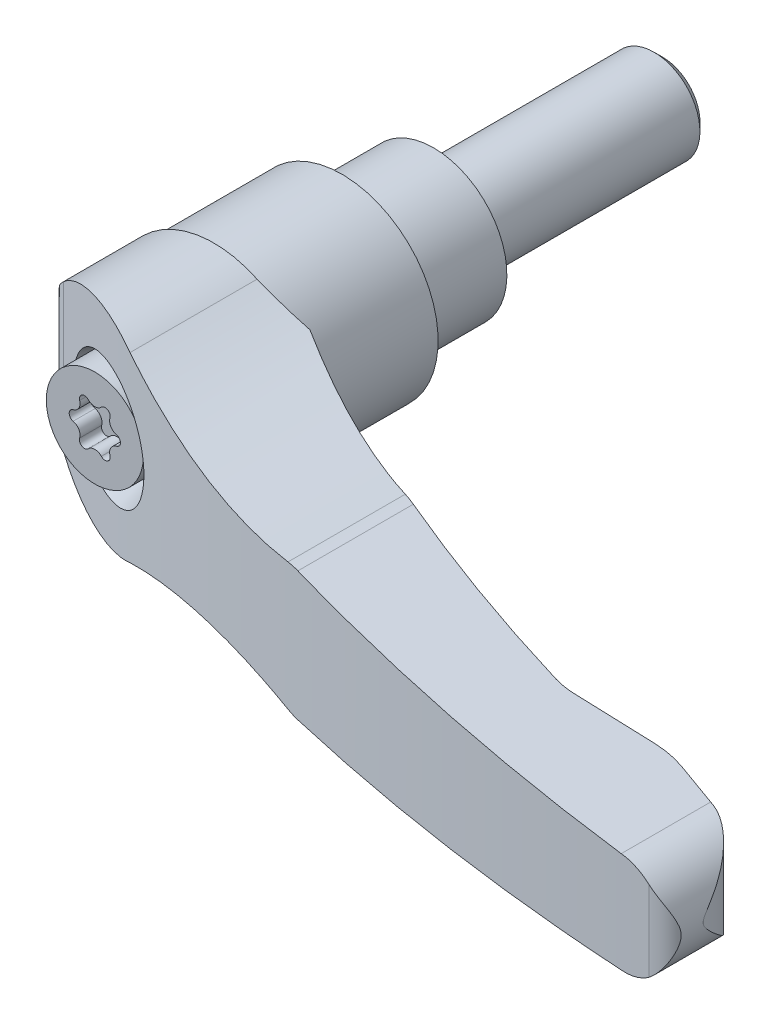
ISO-10303-21;
HEADER;
FILE_DESCRIPTION(('STEP AP214'),'2;1');
FILE_NAME('part.step','',(''),(''),'','','');
FILE_SCHEMA(('AUTOMOTIVE_DESIGN { 1 0 10303 214 1 1 1 1 }'));
ENDSEC;
DATA;
#1=APPLICATION_CONTEXT('core data for automotive mechanical design processes');
#2=APPLICATION_PROTOCOL_DEFINITION('international standard','automotive_design',2000,#1);
#3=PRODUCT_CONTEXT('',#1,'mechanical');
#4=PRODUCT('Part','Part','',(#3));
#5=PRODUCT_RELATED_PRODUCT_CATEGORY('part','',(#4));
#6=PRODUCT_DEFINITION_FORMATION('','',#4);
#7=PRODUCT_DEFINITION_CONTEXT('part definition',#1,'design');
#8=PRODUCT_DEFINITION('design','',#6,#7);
#9=PRODUCT_DEFINITION_SHAPE('','',#8);
#10=(LENGTH_UNIT() NAMED_UNIT(*) SI_UNIT(.MILLI.,.METRE.));
#11=(NAMED_UNIT(*) PLANE_ANGLE_UNIT() SI_UNIT($,.RADIAN.));
#12=(NAMED_UNIT(*) SI_UNIT($,.STERADIAN.) SOLID_ANGLE_UNIT());
#13=UNCERTAINTY_MEASURE_WITH_UNIT(LENGTH_MEASURE(1.E-05),#10,'distance_accuracy_value','');
#14=(GEOMETRIC_REPRESENTATION_CONTEXT(3) GLOBAL_UNCERTAINTY_ASSIGNED_CONTEXT((#13)) GLOBAL_UNIT_ASSIGNED_CONTEXT((#10,
#11,#12)) REPRESENTATION_CONTEXT('',''));
#15=CARTESIAN_POINT('',(0.,0.,0.));
#16=DIRECTION('',(0.,0.,1.));
#17=DIRECTION('',(1.,0.,0.));
#18=AXIS2_PLACEMENT_3D('',#15,#16,#17);
#19=CARTESIAN_POINT('',(0.,0.,-9.53924875));
#20=DIRECTION('',(0.,0.,-1.));
#21=DIRECTION('',(0.,1.,0.));
#22=AXIS2_PLACEMENT_3D('',#19,#20,#21);
#23=CYLINDRICAL_SURFACE('',#22,5.);
#24=CARTESIAN_POINT('',(0.,0.,-24.08));
#25=DIRECTION('',(0.,0.,-1.));
#26=DIRECTION('',(0.,1.,0.));
#27=AXIS2_PLACEMENT_3D('',#24,#25,#26);
#28=CIRCLE('',#27,5.);
#29=CARTESIAN_POINT('',(0.,5.,-24.08));
#30=VERTEX_POINT('',#29);
#31=EDGE_CURVE('E9',#30,#30,#28,.F.);
#32=ORIENTED_EDGE('',*,*,#31,.T.);
#33=EDGE_LOOP('',(#32));
#34=FACE_BOUND('',#33,.T.);
#35=CARTESIAN_POINT('',(0.,0.,0.));
#36=DIRECTION('',(0.,0.,-1.));
#37=DIRECTION('',(0.,1.,0.));
#38=AXIS2_PLACEMENT_3D('',#35,#36,#37);
#39=CIRCLE('',#38,5.);
#40=CARTESIAN_POINT('',(0.,5.,0.));
#41=VERTEX_POINT('',#40);
#42=EDGE_CURVE('E616',#41,#41,#39,.F.);
#43=ORIENTED_EDGE('',*,*,#42,.F.);
#44=EDGE_LOOP('',(#43));
#45=FACE_BOUND('',#44,.T.);
#46=ADVANCED_FACE('F14',(#34,#45),#23,.T.);
#47=CARTESIAN_POINT('',(6.5,0.,0.));
#48=DIRECTION('',(0.,0.,-1.));
#49=DIRECTION('',(0.,1.,0.));
#50=AXIS2_PLACEMENT_3D('',#47,#48,#49);
#51=PLANE('',#50);
#52=ORIENTED_EDGE('',*,*,#42,.T.);
#53=EDGE_LOOP('',(#52));
#54=FACE_BOUND('',#53,.T.);
#55=CARTESIAN_POINT('',(0.,0.,0.));
#56=DIRECTION('',(0.,0.,-1.));
#57=DIRECTION('',(0.,1.,0.));
#58=AXIS2_PLACEMENT_3D('',#55,#56,#57);
#59=CIRCLE('',#58,8.);
#60=CARTESIAN_POINT('',(0.,8.,0.));
#61=VERTEX_POINT('',#60);
#62=EDGE_CURVE('E699',#61,#61,#59,.F.);
#63=ORIENTED_EDGE('',*,*,#62,.F.);
#64=EDGE_LOOP('',(#63));
#65=FACE_BOUND('',#64,.T.);
#66=ADVANCED_FACE('F496',(#54,#65),#51,.T.);
#67=CARTESIAN_POINT('',(0.,0.,11.15));
#68=DIRECTION('',(0.,0.,-1.));
#69=DIRECTION('',(0.,1.,0.));
#70=AXIS2_PLACEMENT_3D('',#67,#68,#69);
#71=CYLINDRICAL_SURFACE('',#70,8.);
#72=ORIENTED_EDGE('',*,*,#62,.T.);
#73=EDGE_LOOP('',(#72));
#74=FACE_BOUND('',#73,.T.);
#75=CARTESIAN_POINT('',(0.,0.,10.7));
#76=DIRECTION('',(0.,0.,-1.));
#77=DIRECTION('',(1.,0.,0.));
#78=AXIS2_PLACEMENT_3D('',#75,#76,#77);
#79=CIRCLE('',#78,8.);
#80=CARTESIAN_POINT('',(8.,0.,10.7));
#81=VERTEX_POINT('',#80);
#82=EDGE_CURVE('E609',#81,#81,#79,.T.);
#83=ORIENTED_EDGE('',*,*,#82,.T.);
#84=EDGE_LOOP('',(#83));
#85=FACE_BOUND('',#84,.T.);
#86=ADVANCED_FACE('F487',(#74,#85),#71,.T.);
#87=CARTESIAN_POINT('',(0.,0.,10.4));
#88=DIRECTION('',(0.,0.,-1.));
#89=DIRECTION('',(0.,1.,0.));
#90=AXIS2_PLACEMENT_3D('',#87,#88,#89);
#91=CONICAL_SURFACE('',#90,8.3,0.785398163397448);
#92=ORIENTED_EDGE('',*,*,#82,.F.);
#93=EDGE_LOOP('',(#92));
#94=FACE_BOUND('',#93,.T.);
#95=CARTESIAN_POINT('',(0.,0.,10.4));
#96=DIRECTION('',(0.,0.,-1.));
#97=DIRECTION('',(0.,1.,0.));
#98=AXIS2_PLACEMENT_3D('',#95,#96,#97);
#99=CIRCLE('',#98,8.3);
#100=CARTESIAN_POINT('',(0.,8.3,10.4));
#101=VERTEX_POINT('',#100);
#102=EDGE_CURVE('E605',#101,#101,#99,.T.);
#103=ORIENTED_EDGE('',*,*,#102,.T.);
#104=EDGE_LOOP('',(#103));
#105=FACE_BOUND('',#104,.T.);
#106=ADVANCED_FACE('F483',(#94,#105),#91,.F.);
#107=CARTESIAN_POINT('',(0.,0.,9.7));
#108=DIRECTION('',(0.,0.,-1.));
#109=DIRECTION('',(0.,1.,0.));
#110=AXIS2_PLACEMENT_3D('',#107,#108,#109);
#111=CYLINDRICAL_SURFACE('',#110,8.3);
#112=ORIENTED_EDGE('',*,*,#102,.F.);
#113=EDGE_LOOP('',(#112));
#114=FACE_BOUND('',#113,.T.);
#115=CARTESIAN_POINT('',(0.,0.,10.));
#116=DIRECTION('',(0.,0.,-1.));
#117=DIRECTION('',(0.,1.,0.));
#118=AXIS2_PLACEMENT_3D('',#115,#116,#117);
#119=CIRCLE('',#118,8.3);
#120=CARTESIAN_POINT('',(0.,8.3,10.));
#121=VERTEX_POINT('',#120);
#122=EDGE_CURVE('E608',#121,#121,#119,.F.);
#123=ORIENTED_EDGE('',*,*,#122,.F.);
#124=EDGE_LOOP('',(#123));
#125=FACE_BOUND('',#124,.T.);
#126=ADVANCED_FACE('F479',(#114,#125),#111,.F.);
#127=CARTESIAN_POINT('',(-5.26,0.,10.));
#128=DIRECTION('',(0.,0.,-1.));
#129=DIRECTION('',(0.,1.,0.));
#130=AXIS2_PLACEMENT_3D('',#127,#128,#129);
#131=PLANE('',#130);
#132=CARTESIAN_POINT('',(-0.00999999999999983,0.,10.));
#133=DIRECTION('',(0.,0.,1.));
#134=DIRECTION('',(-1.,0.,0.));
#135=AXIS2_PLACEMENT_3D('',#132,#133,#134);
#136=CIRCLE('',#135,10.5);
#137=CARTESIAN_POINT('',(-10.2600377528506,-2.27743848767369,10.));
#138=VERTEX_POINT('',#137);
#139=CARTESIAN_POINT('',(-10.2600377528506,2.27743848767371,10.));
#140=VERTEX_POINT('',#139);
#141=EDGE_CURVE('E707',#138,#140,#136,.T.);
#142=ORIENTED_EDGE('',*,*,#141,.F.);
#143=DIRECTION('',(0.,-1.,0.));
#144=VECTOR('',#143,1.);
#145=CARTESIAN_POINT('',(-10.2600377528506,-22.,10.));
#146=LINE('',#145,#144);
#147=EDGE_CURVE('E706',#138,#140,#146,.F.);
#148=ORIENTED_EDGE('',*,*,#147,.T.);
#149=EDGE_LOOP('',(#142,#148));
#150=FACE_BOUND('',#149,.T.);
#151=ORIENTED_EDGE('',*,*,#122,.T.);
#152=EDGE_LOOP('',(#151));
#153=FACE_BOUND('',#152,.T.);
#154=ADVANCED_FACE('F475',(#150,#153),#131,.T.);
#155=CARTESIAN_POINT('',(-10.2600377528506,-22.,10.));
#156=DIRECTION('',(0.707106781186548,0.,0.707106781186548));
#157=DIRECTION('',(-0.707106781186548,0.,0.707106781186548));
#158=AXIS2_PLACEMENT_3D('',#155,#156,#157);
#159=PLANE('',#158);
#160=ORIENTED_EDGE('',*,*,#147,.F.);
#161=CARTESIAN_POINT('',(-0.00999999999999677,0.,-0.250037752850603));
#162=DIRECTION('',(0.707106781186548,0.,0.707106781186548));
#163=DIRECTION('',(-0.707106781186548,0.,0.707106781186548));
#164=AXIS2_PLACEMENT_3D('',#161,#162,#163);
#165=ELLIPSE('',#164,14.8492424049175,10.5);
#166=EDGE_CURVE('E709',#140,#138,#165,.T.);
#167=ORIENTED_EDGE('',*,*,#166,.F.);
#168=EDGE_LOOP('',(#160,#167));
#169=FACE_BOUND('',#168,.T.);
#170=ADVANCED_FACE('F471',(#169),#159,.F.);
#171=CARTESIAN_POINT('',(-0.0100000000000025,0.,18.90625));
#172=DIRECTION('',(0.,0.,1.));
#173=DIRECTION('',(-1.,0.,0.));
#174=AXIS2_PLACEMENT_3D('',#171,#172,#173);
#175=CYLINDRICAL_SURFACE('',#174,10.5);
#176=CARTESIAN_POINT('',(-0.010000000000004,0.,24.));
#177=DIRECTION('',(0.,0.,1.));
#178=DIRECTION('',(-1.,0.,0.));
#179=AXIS2_PLACEMENT_3D('',#176,#177,#178);
#180=CIRCLE('',#179,10.5);
#181=CARTESIAN_POINT('',(-10.51,0.,24.));
#182=VERTEX_POINT('',#181);
#183=CARTESIAN_POINT('',(10.49,0.,24.));
#184=VERTEX_POINT('',#183);
#185=EDGE_CURVE('E456',#182,#184,#180,.T.);
#186=ORIENTED_EDGE('',*,*,#185,.F.);
#187=CARTESIAN_POINT('',(-0.010000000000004,0.,24.));
#188=DIRECTION('',(0.,0.,1.));
#189=DIRECTION('',(-1.,0.,0.));
#190=AXIS2_PLACEMENT_3D('',#187,#188,#189);
#191=CIRCLE('',#190,10.5);
#192=EDGE_CURVE('E591',#184,#182,#191,.T.);
#193=ORIENTED_EDGE('',*,*,#192,.F.);
#194=EDGE_LOOP('',(#186,#193));
#195=FACE_BOUND('',#194,.T.);
#196=ORIENTED_EDGE('',*,*,#141,.T.);
#197=ORIENTED_EDGE('',*,*,#166,.T.);
#198=EDGE_LOOP('',(#196,#197));
#199=FACE_BOUND('',#198,.T.);
#200=ADVANCED_FACE('F467',(#195,#199),#175,.T.);
#201=CARTESIAN_POINT('',(-10.51,-12.,24.));
#202=DIRECTION('',(0.,0.,-1.));
#203=DIRECTION('',(0.,1.,0.));
#204=AXIS2_PLACEMENT_3D('',#201,#202,#203);
#205=PLANE('',#204);
#206=ORIENTED_EDGE('',*,*,#185,.T.);
#207=DIRECTION('',(0.,-1.,0.));
#208=VECTOR('',#207,1.);
#209=CARTESIAN_POINT('',(10.4900000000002,-12.,23.9999999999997));
#210=LINE('',#209,#208);
#211=CARTESIAN_POINT('',(10.4900000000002,-8.03465812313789,24.));
#212=VERTEX_POINT('',#211);
#213=EDGE_CURVE('E442',#184,#212,#210,.T.);
#214=ORIENTED_EDGE('',*,*,#213,.T.);
#215=CARTESIAN_POINT('',(22.94,-55.53,24.));
#216=DIRECTION('',(0.,0.,1.));
#217=DIRECTION('',(0.,-1.,0.));
#218=AXIS2_PLACEMENT_3D('',#215,#216,#217);
#219=CIRCLE('',#218,49.1);
#220=CARTESIAN_POINT('',(4.72251026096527,-9.93468151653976,24.));
#221=VERTEX_POINT('',#220);
#222=EDGE_CURVE('E746',#212,#221,#219,.T.);
#223=ORIENTED_EDGE('',*,*,#222,.T.);
#224=CARTESIAN_POINT('',(0.,0.,24.));
#225=DIRECTION('',(0.,0.,1.));
#226=DIRECTION('',(0.,-1.,0.));
#227=AXIS2_PLACEMENT_3D('',#224,#225,#226);
#228=CIRCLE('',#227,11.);
#229=CARTESIAN_POINT('',(-10.51,-3.24652121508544,24.));
#230=VERTEX_POINT('',#229);
#231=EDGE_CURVE('E740',#230,#221,#228,.T.);
#232=ORIENTED_EDGE('',*,*,#231,.F.);
#233=DIRECTION('',(0.,-1.,0.));
#234=VECTOR('',#233,1.);
#235=CARTESIAN_POINT('',(-10.51,-12.,24.));
#236=LINE('',#235,#234);
#237=EDGE_CURVE('E590',#182,#230,#236,.T.);
#238=ORIENTED_EDGE('',*,*,#237,.F.);
#239=EDGE_LOOP('',(#206,#214,#223,#232,#238));
#240=FACE_BOUND('',#239,.T.);
#241=ADVANCED_FACE('F462',(#240),#205,.T.);
#242=CARTESIAN_POINT('',(31.3589689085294,0.945932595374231,54.5));
#243=DIRECTION('',(0.,0.,1.));
#244=DIRECTION('',(0.,-1.,0.));
#245=AXIS2_PLACEMENT_3D('',#242,#243,#244);
#246=CYLINDRICAL_SURFACE('',#245,8.00000000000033);
#247=CARTESIAN_POINT('',(31.6479325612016,-7.04884695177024,46.4731806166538));
#248=CARTESIAN_POINT('',(31.4018180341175,-7.05768532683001,46.4087993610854));
#249=CARTESIAN_POINT('',(31.1563854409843,-7.05525330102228,46.3442255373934));
#250=CARTESIAN_POINT('',(30.66688412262,-7.02784844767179,46.2146927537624));
#251=CARTESIAN_POINT('',(30.4228153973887,-7.00287562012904,46.1497337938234));
#252=CARTESIAN_POINT('',(30.1794286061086,-6.96663239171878,46.0845822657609));
#253=B_SPLINE_CURVE_WITH_KNOTS('',3,(#247,#248,#249,#250,#251,#252),.UNSPECIFIED.,.F.,.F.,(4,2,
4),(0.,0.76139061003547,1.52278122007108),.UNSPECIFIED.);
#254=CARTESIAN_POINT('',(31.6479325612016,-7.04884695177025,46.4731806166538));
#255=VERTEX_POINT('',#254);
#256=CARTESIAN_POINT('',(30.1794286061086,-6.96663239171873,46.084582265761));
#257=VERTEX_POINT('',#256);
#258=EDGE_CURVE('E449',#255,#257,#253,.T.);
#259=ORIENTED_EDGE('',*,*,#258,.T.);
#260=DIRECTION('',(0.,0.,1.));
#261=VECTOR('',#260,1.);
#262=CARTESIAN_POINT('',(30.1794286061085,-6.96663239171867,54.5));
#263=LINE('',#262,#261);
#264=CARTESIAN_POINT('',(30.1794286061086,-6.96663239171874,33.2732494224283));
#265=VERTEX_POINT('',#264);
#266=EDGE_CURVE('E741',#257,#265,#263,.F.);
#267=ORIENTED_EDGE('',*,*,#266,.T.);
#268=CARTESIAN_POINT('',(30.1794286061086,-6.9666323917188,33.2732494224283));
#269=CARTESIAN_POINT('',(30.4222007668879,-7.00282816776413,33.3728739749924));
#270=CARTESIAN_POINT('',(30.6665043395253,-7.02781937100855,33.4725985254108));
#271=CARTESIAN_POINT('',(31.0339219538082,-7.04840105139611,33.6217860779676));
#272=CARTESIAN_POINT('',(31.1565128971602,-7.05244559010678,33.6714318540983));
#273=CARTESIAN_POINT('',(31.4020580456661,-7.05489552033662,33.7706062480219));
#274=CARTESIAN_POINT('',(31.5250125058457,-7.05329063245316,33.8201344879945));
#275=CARTESIAN_POINT('',(31.6479325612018,-7.04884695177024,33.8695155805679));
#276=B_SPLINE_CURVE_WITH_KNOTS('',3,(#268,#269,#270,#271,#272,#273,#274,#275),.UNSPECIFIED.,.F.,
.F.,(4,2,2,4),(0.,0.794258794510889,1.19111760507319,1.58869889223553),.UNSPECIFIED.);
#277=CARTESIAN_POINT('',(31.6479325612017,-7.04884695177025,33.8695155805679));
#278=VERTEX_POINT('',#277);
#279=EDGE_CURVE('E444',#265,#278,#276,.T.);
#280=ORIENTED_EDGE('',*,*,#279,.T.);
#281=DIRECTION('',(0.,0.,1.));
#282=VECTOR('',#281,1.);
#283=CARTESIAN_POINT('',(31.6479325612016,-7.04884695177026,54.5));
#284=LINE('',#283,#282);
#285=EDGE_CURVE('E751',#278,#255,#284,.T.);
#286=ORIENTED_EDGE('',*,*,#285,.T.);
#287=EDGE_LOOP('',(#259,#267,#280,#286));
#288=FACE_BOUND('',#287,.T.);
#289=ADVANCED_FACE('F458',(#288),#246,.T.);
#290=CARTESIAN_POINT('',(79.9967051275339,-12.,50.5395921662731));
#291=DIRECTION('',(0.992331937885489,0.,-0.123601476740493));
#292=DIRECTION('',(0.123601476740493,0.,0.992331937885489));
#293=AXIS2_PLACEMENT_3D('',#290,#291,#292);
#294=PLANE('',#293);
#295=CARTESIAN_POINT('',(79.9967051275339,-0.190348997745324,50.5395921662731));
#296=CARTESIAN_POINT('',(79.9969785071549,-0.182455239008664,50.5417867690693));
#297=CARTESIAN_POINT('',(79.9972360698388,-0.174525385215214,50.543854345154));
#298=CARTESIAN_POINT('',(79.9977166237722,-0.158664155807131,50.5477118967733));
#299=CARTESIAN_POINT('',(79.9979398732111,-0.150733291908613,50.5495039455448));
#300=CARTESIAN_POINT('',(79.9983518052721,-0.134870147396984,50.5528105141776));
#301=CARTESIAN_POINT('',(79.998540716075,-0.12693825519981,50.5543268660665));
#302=CARTESIAN_POINT('',(79.9988840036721,-0.111073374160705,50.5570823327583));
#303=CARTESIAN_POINT('',(79.9990385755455,-0.103140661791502,50.5583230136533));
#304=CARTESIAN_POINT('',(79.9993132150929,-0.087274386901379,50.5605274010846));
#305=CARTESIAN_POINT('',(79.9994334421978,-0.0793410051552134,50.5614923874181));
#306=CARTESIAN_POINT('',(79.9996394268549,-0.0634736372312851,50.5631456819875));
#307=CARTESIAN_POINT('',(79.9997253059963,-0.0555397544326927,50.5638349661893));
#308=CARTESIAN_POINT('',(79.9998626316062,-0.0396716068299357,50.5649371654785));
#309=CARTESIAN_POINT('',(79.9999141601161,-0.0317373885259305,50.5653507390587));
#310=CARTESIAN_POINT('',(79.9999828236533,-0.0158687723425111,50.5659018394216));
#311=CARTESIAN_POINT('',(80.,-0.00793438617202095,50.5660396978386));
#312=CARTESIAN_POINT('',(80.,0.00793438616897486,50.5660396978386));
#313=CARTESIAN_POINT('',(79.9999828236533,0.0158687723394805,50.5659018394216));
#314=CARTESIAN_POINT('',(79.9999141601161,0.0317373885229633,50.5653507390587));
#315=CARTESIAN_POINT('',(79.9998626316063,0.0396716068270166,50.5649371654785));
#316=CARTESIAN_POINT('',(79.9997253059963,0.0555397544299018,50.5638349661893));
#317=CARTESIAN_POINT('',(79.9996394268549,0.0634736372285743,50.5631456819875));
#318=CARTESIAN_POINT('',(79.9994334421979,0.0793410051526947,50.5614923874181));
#319=CARTESIAN_POINT('',(79.9993132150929,0.0872743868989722,50.5605274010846));
#320=CARTESIAN_POINT('',(79.9990385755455,0.103140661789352,50.5583230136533));
#321=CARTESIAN_POINT('',(79.9988840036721,0.111073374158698,50.5570823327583));
#322=CARTESIAN_POINT('',(79.998540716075,0.126938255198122,50.5543268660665));
#323=CARTESIAN_POINT('',(79.9983518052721,0.134870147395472,50.5528105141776));
#324=CARTESIAN_POINT('',(79.9979398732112,0.150733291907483,50.5495039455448));
#325=CARTESIAN_POINT('',(79.9977166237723,0.158664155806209,50.5477118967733));
#326=CARTESIAN_POINT('',(79.9972360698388,0.174525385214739,50.543854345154));
#327=CARTESIAN_POINT('',(79.9969785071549,0.182455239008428,50.5417867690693));
#328=CARTESIAN_POINT('',(79.9967051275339,0.190348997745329,50.5395921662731));
#329=B_SPLINE_CURVE_WITH_KNOTS('',3,(#295,#296,#297,#298,#299,#300,#301,#302,#303,#304,#305,
#306,#307,#308,#309,#310,#311,#312,#313,#314,#315,#316,#317,#318,#319,#320,#321,#322,#323,#324,
#325,#326,#327,#328),.UNSPECIFIED.,.F.,.F.,(4,2,2,2,2,2,2,2,2,2,2,2,2,2,2,2,4),(0.,
0.0245923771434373,0.0489895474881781,0.0732181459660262,0.0973053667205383,0.121278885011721,
0.145166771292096,0.168997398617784,0.19279934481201,0.216601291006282,0.240431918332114,
0.264319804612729,0.288293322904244,0.312380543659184,0.336609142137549,0.361006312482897,
0.385598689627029),.UNSPECIFIED.);
#330=CARTESIAN_POINT('',(79.9967051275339,-0.190348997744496,50.5395921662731));
#331=VERTEX_POINT('',#330);
#332=CARTESIAN_POINT('',(79.9967051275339,0.190348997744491,50.5395921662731));
#333=VERTEX_POINT('',#332);
#334=EDGE_CURVE('E370',#331,#333,#329,.T.);
#335=ORIENTED_EDGE('',*,*,#334,.F.);
#336=DIRECTION('',(0.,-1.,0.));
#337=VECTOR('',#336,1.);
#338=CARTESIAN_POINT('',(79.9967051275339,-12.,50.5395921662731));
#339=LINE('',#338,#337);
#340=EDGE_CURVE('E455',#333,#331,#339,.T.);
#341=ORIENTED_EDGE('',*,*,#340,.F.);
#342=EDGE_LOOP('',(#335,#341));
#343=FACE_BOUND('',#342,.T.);
#344=ADVANCED_FACE('F399',(#343),#294,.T.);
#345=CARTESIAN_POINT('',(72.6137555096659,-12.,51.4591871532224));
#346=DIRECTION('',(0.,-1.,0.));
#347=DIRECTION('',(1.,0.,0.));
#348=AXIS2_PLACEMENT_3D('',#345,#346,#347);
#349=CYLINDRICAL_SURFACE('',#348,7.44);
#350=CARTESIAN_POINT('',(79.9967051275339,0.190348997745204,50.5395921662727));
#351=CARTESIAN_POINT('',(79.9951469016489,0.235214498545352,50.5270575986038));
#352=CARTESIAN_POINT('',(79.9930953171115,0.27873685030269,50.5108629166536));
#353=CARTESIAN_POINT('',(79.988164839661,0.363077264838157,50.4732708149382));
#354=CARTESIAN_POINT('',(79.9852922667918,0.40391316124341,50.4519133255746));
#355=CARTESIAN_POINT('',(79.975702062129,0.52245816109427,50.3833482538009));
#356=CARTESIAN_POINT('',(79.9679715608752,0.597169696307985,50.3312876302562));
#357=CARTESIAN_POINT('',(79.9508869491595,0.736456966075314,50.2251559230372));
#358=CARTESIAN_POINT('',(79.9416856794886,0.801375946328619,50.1714851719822));
#359=CARTESIAN_POINT('',(79.9214540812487,0.928420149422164,50.0612288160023));
#360=CARTESIAN_POINT('',(79.9104232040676,0.990544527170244,50.0046423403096));
#361=CARTESIAN_POINT('',(79.8746515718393,1.17419942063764,49.8323129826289));
#362=CARTESIAN_POINT('',(79.8472488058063,1.29287988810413,49.7141099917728));
#363=CARTESIAN_POINT('',(79.7848398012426,1.52823594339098,49.4729704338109));
#364=CARTESIAN_POINT('',(79.7496926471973,1.64482416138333,49.3499864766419));
#365=CARTESIAN_POINT('',(79.6721004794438,1.87458318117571,49.1033284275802));
#366=CARTESIAN_POINT('',(79.6296610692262,1.98775652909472,48.9796549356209));
#367=CARTESIAN_POINT('',(79.5033816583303,2.29352791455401,48.6415502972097));
#368=CARTESIAN_POINT('',(79.4120558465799,2.48329449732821,48.427296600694));
#369=CARTESIAN_POINT('',(79.2061355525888,2.85434488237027,48.0023120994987));
#370=CARTESIAN_POINT('',(79.0915236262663,3.03562219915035,47.7915840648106));
#371=CARTESIAN_POINT('',(78.8390032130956,3.38665877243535,47.3777391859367));
#372=CARTESIAN_POINT('',(78.7012752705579,3.5564939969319,47.1745772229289));
#373=CARTESIAN_POINT('',(78.4009143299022,3.88356808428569,46.7768350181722));
#374=CARTESIAN_POINT('',(78.2383021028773,4.04081728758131,46.5822477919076));
#375=CARTESIAN_POINT('',(77.9568022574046,4.2801698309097,46.2794503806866));
#376=CARTESIAN_POINT('',(77.8461272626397,4.36735584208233,46.1675710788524));
#377=CARTESIAN_POINT('',(77.61512986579,4.53501217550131,45.9487274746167));
#378=CARTESIAN_POINT('',(77.494805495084,4.61548112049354,45.8417641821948));
#379=CARTESIAN_POINT('',(77.2447591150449,4.7684092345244,45.6339165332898));
#380=CARTESIAN_POINT('',(77.1150589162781,4.84088606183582,45.5330190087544));
#381=CARTESIAN_POINT('',(76.8461728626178,4.97676025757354,45.3380932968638));
#382=CARTESIAN_POINT('',(76.7069926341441,5.04016294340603,45.2440611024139));
#383=CARTESIAN_POINT('',(76.4438690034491,5.14664435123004,45.0792448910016));
#384=CARTESIAN_POINT('',(76.3213555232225,5.19134589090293,45.0072256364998));
#385=CARTESIAN_POINT('',(76.0703754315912,5.27269544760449,44.8693561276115));
#386=CARTESIAN_POINT('',(75.9419112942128,5.30934677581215,44.8035033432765));
#387=CARTESIAN_POINT('',(75.678496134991,5.37397975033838,44.6781572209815));
#388=CARTESIAN_POINT('',(75.5435027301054,5.40189236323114,44.6187168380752));
#389=CARTESIAN_POINT('',(75.2686009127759,5.44782102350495,44.507386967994));
#390=CARTESIAN_POINT('',(75.1286862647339,5.46582399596,44.4555075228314));
#391=CARTESIAN_POINT('',(74.9868127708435,5.47841339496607,44.407790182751));
#392=B_SPLINE_CURVE_WITH_KNOTS('',3,(#350,#351,#352,#353,#354,#355,#356,#357,#358,#359,#360,
#361,#362,#363,#364,#365,#366,#367,#368,#369,#370,#371,#372,#373,#374,#375,#376,#377,#378,#379,
#380,#381,#382,#383,#384,#385,#386,#387,#388,#389,#390,#391),.UNSPECIFIED.,.F.,.F.,(4,2,2,2,2,2,
2,2,2,2,2,2,2,2,2,2,2,2,2,2,4),(0.,0.139245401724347,0.277446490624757,0.550810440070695,
0.804906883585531,1.05907965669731,1.56794086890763,2.08696422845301,2.60559053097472,
3.50582150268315,4.40672935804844,5.30090298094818,6.1943342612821,6.73367946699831,
7.27313498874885,7.81137365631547,8.3492956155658,8.79580649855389,9.24213337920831,
9.69190199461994,10.1422626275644),.UNSPECIFIED.);
#393=CARTESIAN_POINT('',(74.9868127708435,5.47841339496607,44.407790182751));
#394=VERTEX_POINT('',#393);
#395=EDGE_CURVE('E387',#333,#394,#392,.T.);
#396=ORIENTED_EDGE('',*,*,#395,.F.);
#397=ORIENTED_EDGE('',*,*,#340,.T.);
#398=CARTESIAN_POINT('',(74.9868127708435,-5.47841339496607,44.407790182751));
#399=CARTESIAN_POINT('',(75.1398120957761,-5.46484028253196,44.459242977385));
#400=CARTESIAN_POINT('',(75.2905169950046,-5.44496899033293,44.5155387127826));
#401=CARTESIAN_POINT('',(75.5860882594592,-5.39377415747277,44.6368581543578));
#402=CARTESIAN_POINT('',(75.7309637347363,-5.36246932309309,44.7018674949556));
#403=CARTESIAN_POINT('',(76.0125967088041,-5.28989557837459,44.8390817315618));
#404=CARTESIAN_POINT('',(76.1494251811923,-5.24873835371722,44.9112009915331));
#405=CARTESIAN_POINT('',(76.4161065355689,-5.15736483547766,45.0623731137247));
#406=CARTESIAN_POINT('',(76.5459558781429,-5.10714400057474,45.1414294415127));
#407=CARTESIAN_POINT('',(76.8276536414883,-4.98604991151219,45.3247681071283));
#408=CARTESIAN_POINT('',(76.9775772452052,-4.91309116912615,45.4306358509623));
#409=CARTESIAN_POINT('',(77.265789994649,-4.75681575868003,45.6501400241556));
#410=CARTESIAN_POINT('',(77.4040776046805,-4.67349772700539,45.7637774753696));
#411=CARTESIAN_POINT('',(77.8028296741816,-4.40945601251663,46.1156758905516));
#412=CARTESIAN_POINT('',(78.0457801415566,-4.21527563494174,46.3639882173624));
#413=CARTESIAN_POINT('',(78.417694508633,-3.86589184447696,46.7984433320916));
#414=CARTESIAN_POINT('',(78.5586476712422,-3.71726415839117,46.9799982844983));
#415=CARTESIAN_POINT('',(78.8199419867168,-3.41009407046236,47.3496806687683));
#416=CARTESIAN_POINT('',(78.940273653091,-3.25154715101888,47.537811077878));
#417=CARTESIAN_POINT('',(79.1607378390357,-2.92676895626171,47.9181651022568));
#418=CARTESIAN_POINT('',(79.2609186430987,-2.76055725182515,48.1103776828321));
#419=CARTESIAN_POINT('',(79.4421677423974,-2.42115236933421,48.4974286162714));
#420=CARTESIAN_POINT('',(79.5232445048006,-2.24796232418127,48.692265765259));
#421=CARTESIAN_POINT('',(79.6578968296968,-1.91676087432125,49.0578102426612));
#422=CARTESIAN_POINT('',(79.7136489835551,-1.75958096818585,49.2284695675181));
#423=CARTESIAN_POINT('',(79.786963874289,-1.51825146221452,49.4826945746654));
#424=CARTESIAN_POINT('',(79.8097141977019,-1.43673320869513,49.567289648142));
#425=CARTESIAN_POINT('',(79.8517302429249,-1.27132927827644,49.7350141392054));
#426=CARTESIAN_POINT('',(79.870996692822,-1.18744410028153,49.8181438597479));
#427=CARTESIAN_POINT('',(79.9071865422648,-1.01046435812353,49.9869732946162));
#428=CARTESIAN_POINT('',(79.9238666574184,-0.917129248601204,50.0724723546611));
#429=CARTESIAN_POINT('',(79.9529450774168,-0.724505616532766,50.2358460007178));
#430=CARTESIAN_POINT('',(79.9653823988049,-0.625281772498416,50.3137850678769));
#431=CARTESIAN_POINT('',(79.9802376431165,-0.468580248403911,50.4153149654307));
#432=CARTESIAN_POINT('',(79.9845030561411,-0.416215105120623,50.4460963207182));
#433=CARTESIAN_POINT('',(79.9917045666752,-0.30687937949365,50.4998809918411));
#434=CARTESIAN_POINT('',(79.9946243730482,-0.249861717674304,50.5227881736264));
#435=CARTESIAN_POINT('',(79.9967051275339,-0.190348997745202,50.5395921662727));
#436=B_SPLINE_CURVE_WITH_KNOTS('',3,(#398,#399,#400,#401,#402,#403,#404,#405,#406,#407,#408,
#409,#410,#411,#412,#413,#414,#415,#416,#417,#418,#419,#420,#421,#422,#423,#424,#425,#426,#427,
#428,#429,#430,#431,#432,#433,#434,#435),.UNSPECIFIED.,.F.,.F.,(4,2,2,2,2,2,2,2,2,2,2,2,2,2,2,2,
2,2,4),(0.,0.485611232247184,0.970431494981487,1.44999646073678,1.92980238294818,
2.52141817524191,3.11311192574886,4.30183389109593,5.12208341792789,5.94270927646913,
6.76134473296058,7.57961667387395,8.29494630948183,8.65387747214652,9.01273353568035,
9.39561932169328,9.77488268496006,9.95698827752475,10.141244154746),.UNSPECIFIED.);
#437=CARTESIAN_POINT('',(74.9868127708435,-5.47841339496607,44.407790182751));
#438=VERTEX_POINT('',#437);
#439=EDGE_CURVE('E359',#438,#331,#436,.T.);
#440=ORIENTED_EDGE('',*,*,#439,.F.);
#441=DIRECTION('',(0.,-1.,0.));
#442=VECTOR('',#441,1.);
#443=CARTESIAN_POINT('',(74.9868127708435,-12.,44.407790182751));
#444=LINE('',#443,#442);
#445=EDGE_CURVE('E443',#394,#438,#444,.T.);
#446=ORIENTED_EDGE('',*,*,#445,.F.);
#447=EDGE_LOOP('',(#396,#397,#440,#446));
#448=FACE_BOUND('',#447,.T.);
#449=ADVANCED_FACE('F393',(#448),#349,.T.);
#450=CARTESIAN_POINT('',(57.3760512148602,-12.,33.47));
#451=DIRECTION('',(0.,-1.,0.));
#452=DIRECTION('',(1.,0.,0.));
#453=AXIS2_PLACEMENT_3D('',#450,#451,#452);
#454=CYLINDRICAL_SURFACE('',#453,8.58999999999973);
#455=DIRECTION('',(0.,-1.,0.));
#456=VECTOR('',#455,1.);
#457=CARTESIAN_POINT('',(55.1138126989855,-12.,41.756759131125));
#458=LINE('',#457,#456);
#459=CARTESIAN_POINT('',(55.1138126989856,-6.20069518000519,41.7567591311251));
#460=VERTEX_POINT('',#459);
#461=CARTESIAN_POINT('',(55.1138126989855,6.2006951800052,41.7567591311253));
#462=VERTEX_POINT('',#461);
#463=EDGE_CURVE('E735',#460,#462,#458,.F.);
#464=ORIENTED_EDGE('',*,*,#463,.T.);
#465=CARTESIAN_POINT('',(57.3760512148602,6.11892873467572,33.47));
#466=DIRECTION('',(-0.0361204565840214,-0.999347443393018,0.));
#467=DIRECTION('',(0.999347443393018,-0.0361204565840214,0.));
#468=AXIS2_PLACEMENT_3D('',#465,#466,#467);
#469=ELLIPSE('',#468,8.59560912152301,8.58999999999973);
#470=CARTESIAN_POINT('',(57.3760512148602,6.11892873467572,42.06));
#471=VERTEX_POINT('',#470);
#472=EDGE_CURVE('E816',#462,#471,#469,.F.);
#473=ORIENTED_EDGE('',*,*,#472,.T.);
#474=DIRECTION('',(0.,1.,0.));
#475=VECTOR('',#474,1.);
#476=CARTESIAN_POINT('',(57.3760512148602,-12.,42.06));
#477=LINE('',#476,#475);
#478=CARTESIAN_POINT('',(57.3760512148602,-6.11892873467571,42.06));
#479=VERTEX_POINT('',#478);
#480=EDGE_CURVE('E596',#479,#471,#477,.T.);
#481=ORIENTED_EDGE('',*,*,#480,.F.);
#482=CARTESIAN_POINT('',(57.3760512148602,-6.11892873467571,33.47));
#483=DIRECTION('',(-0.0361204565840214,0.999347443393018,0.));
#484=DIRECTION('',(-0.999347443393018,-0.0361204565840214,0.));
#485=AXIS2_PLACEMENT_3D('',#482,#483,#484);
#486=ELLIPSE('',#485,8.59560912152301,8.58999999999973);
#487=EDGE_CURVE('E756',#479,#460,#486,.F.);
#488=ORIENTED_EDGE('',*,*,#487,.T.);
#489=EDGE_LOOP('',(#464,#473,#481,#488));
#490=FACE_BOUND('',#489,.T.);
#491=ADVANCED_FACE('F398',(#490),#454,.F.);
#492=CARTESIAN_POINT('',(57.3760512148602,-12.,42.06));
#493=DIRECTION('',(0.,0.,-1.));
#494=DIRECTION('',(0.,1.,0.));
#495=AXIS2_PLACEMENT_3D('',#492,#493,#494);
#496=PLANE('',#495);
#497=DIRECTION('',(0.999347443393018,-0.0361204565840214,0.));
#498=VECTOR('',#497,1.);
#499=CARTESIAN_POINT('',(31.6479325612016,7.04884695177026,42.06));
#500=LINE('',#499,#498);
#501=CARTESIAN_POINT('',(66.1633245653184,5.80132115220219,42.06));
#502=VERTEX_POINT('',#501);
#503=EDGE_CURVE('E813',#471,#502,#500,.T.);
#504=ORIENTED_EDGE('',*,*,#503,.T.);
#505=DIRECTION('',(0.,-1.,0.));
#506=VECTOR('',#505,1.);
#507=CARTESIAN_POINT('',(66.1633245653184,-12.,42.06));
#508=LINE('',#507,#506);
#509=CARTESIAN_POINT('',(66.1633245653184,-5.80132115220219,42.06));
#510=VERTEX_POINT('',#509);
#511=EDGE_CURVE('E595',#510,#502,#508,.F.);
#512=ORIENTED_EDGE('',*,*,#511,.F.);
#513=DIRECTION('',(-0.999347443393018,-0.0361204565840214,0.));
#514=VECTOR('',#513,1.);
#515=CARTESIAN_POINT('',(74.5,-5.5,42.06));
#516=LINE('',#515,#514);
#517=EDGE_CURVE('E754',#510,#479,#516,.T.);
#518=ORIENTED_EDGE('',*,*,#517,.T.);
#519=ORIENTED_EDGE('',*,*,#480,.T.);
#520=EDGE_LOOP('',(#504,#512,#518,#519));
#521=FACE_BOUND('',#520,.T.);
#522=ADVANCED_FACE('F405',(#521),#496,.T.);
#523=CARTESIAN_POINT('',(66.1633245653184,-12.,53.34));
#524=DIRECTION('',(0.,-1.,0.));
#525=DIRECTION('',(1.,0.,0.));
#526=AXIS2_PLACEMENT_3D('',#523,#524,#525);
#527=CYLINDRICAL_SURFACE('',#526,11.2800000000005);
#528=CARTESIAN_POINT('',(66.1633245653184,5.80132115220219,53.34));
#529=DIRECTION('',(-0.0361204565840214,-0.999347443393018,0.));
#530=DIRECTION('',(0.999347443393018,-0.0361204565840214,0.));
#531=AXIS2_PLACEMENT_3D('',#528,#529,#530);
#532=ELLIPSE('',#531,11.2873656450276,11.2800000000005);
#533=CARTESIAN_POINT('',(69.7611855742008,5.6712799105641,42.6491723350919));
#534=VERTEX_POINT('',#533);
#535=EDGE_CURVE('E815',#502,#534,#532,.T.);
#536=ORIENTED_EDGE('',*,*,#535,.T.);
#537=DIRECTION('',(0.,-1.,0.));
#538=VECTOR('',#537,1.);
#539=CARTESIAN_POINT('',(69.7611855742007,-12.,42.6491723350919));
#540=LINE('',#539,#538);
#541=CARTESIAN_POINT('',(69.7611855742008,-5.6712799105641,42.6491723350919));
#542=VERTEX_POINT('',#541);
#543=EDGE_CURVE('E592',#542,#534,#540,.F.);
#544=ORIENTED_EDGE('',*,*,#543,.F.);
#545=CARTESIAN_POINT('',(66.1633245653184,-5.80132115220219,53.34));
#546=DIRECTION('',(-0.0361204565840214,0.999347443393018,0.));
#547=DIRECTION('',(-0.999347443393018,-0.0361204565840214,0.));
#548=AXIS2_PLACEMENT_3D('',#545,#546,#547);
#549=ELLIPSE('',#548,11.2873656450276,11.2800000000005);
#550=EDGE_CURVE('E757',#542,#510,#549,.T.);
#551=ORIENTED_EDGE('',*,*,#550,.T.);
#552=ORIENTED_EDGE('',*,*,#511,.T.);
#553=EDGE_LOOP('',(#536,#544,#551,#552));
#554=FACE_BOUND('',#553,.T.);
#555=ADVANCED_FACE('F409',(#554),#527,.T.);
#556=CARTESIAN_POINT('',(69.7611855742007,-12.,42.6491723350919));
#557=DIRECTION('',(0.318959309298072,0.,-0.947768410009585));
#558=DIRECTION('',(0.947768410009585,0.,0.318959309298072));
#559=AXIS2_PLACEMENT_3D('',#556,#557,#558);
#560=PLANE('',#559);
#561=ORIENTED_EDGE('',*,*,#445,.T.);
#562=CARTESIAN_POINT('',(74.5,0.,44.2439595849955));
#563=DIRECTION('',(0.318959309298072,0.,-0.947768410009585));
#564=DIRECTION('',(0.947768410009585,0.,0.318959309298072));
#565=AXIS2_PLACEMENT_3D('',#562,#563,#564);
#566=ELLIPSE('',#565,5.80310542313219,5.5);
#567=CARTESIAN_POINT('',(74.5,-5.5,44.2439595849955));
#568=VERTEX_POINT('',#567);
#569=EDGE_CURVE('E750',#568,#438,#566,.F.);
#570=ORIENTED_EDGE('',*,*,#569,.F.);
#571=DIRECTION('',(-0.947212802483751,-0.0342360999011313,-0.318772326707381));
#572=VECTOR('',#571,1.);
#573=CARTESIAN_POINT('',(74.5,-5.5,44.2439595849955));
#574=LINE('',#573,#572);
#575=EDGE_CURVE('E747',#568,#542,#574,.T.);
#576=ORIENTED_EDGE('',*,*,#575,.T.);
#577=ORIENTED_EDGE('',*,*,#543,.T.);
#578=DIRECTION('',(0.947212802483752,-0.0342360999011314,0.31877232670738));
#579=VECTOR('',#578,1.);
#580=CARTESIAN_POINT('',(69.7611855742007,5.6712799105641,42.6491723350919));
#581=LINE('',#580,#579);
#582=CARTESIAN_POINT('',(74.5,5.5,44.2439595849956));
#583=VERTEX_POINT('',#582);
#584=EDGE_CURVE('E809',#534,#583,#581,.T.);
#585=ORIENTED_EDGE('',*,*,#584,.T.);
#586=CARTESIAN_POINT('',(74.5,0.,44.2439595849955));
#587=DIRECTION('',(0.318959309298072,0.,-0.947768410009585));
#588=DIRECTION('',(0.947768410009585,0.,0.318959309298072));
#589=AXIS2_PLACEMENT_3D('',#586,#587,#588);
#590=ELLIPSE('',#589,5.80310542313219,5.5);
#591=EDGE_CURVE('E384',#394,#583,#590,.F.);
#592=ORIENTED_EDGE('',*,*,#591,.F.);
#593=EDGE_LOOP('',(#561,#570,#576,#577,#585,#592));
#594=FACE_BOUND('',#593,.T.);
#595=ADVANCED_FACE('F413',(#594),#560,.T.);
#596=CARTESIAN_POINT('',(31.3589689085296,-0.945932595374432,54.5));
#597=DIRECTION('',(0.,0.,1.));
#598=DIRECTION('',(0.,-1.,0.));
#599=AXIS2_PLACEMENT_3D('',#596,#597,#598);
#600=CYLINDRICAL_SURFACE('',#599,8.00000000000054);
#601=CARTESIAN_POINT('',(30.1794286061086,6.96663239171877,46.0845822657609));
#602=CARTESIAN_POINT('',(30.4228153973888,7.00287562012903,46.1497337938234));
#603=CARTESIAN_POINT('',(30.66688412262,7.02784844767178,46.2146927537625));
#604=CARTESIAN_POINT('',(31.1563854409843,7.05525330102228,46.3442255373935));
#605=CARTESIAN_POINT('',(31.4018180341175,7.05768532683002,46.4087993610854));
#606=CARTESIAN_POINT('',(31.6479325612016,7.04884695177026,46.4731806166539));
#607=B_SPLINE_CURVE_WITH_KNOTS('',3,(#601,#602,#603,#604,#605,#606),.UNSPECIFIED.,.F.,.F.,(4,2,
4),(0.,0.761390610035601,1.52278122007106),.UNSPECIFIED.);
#608=CARTESIAN_POINT('',(30.1794286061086,6.96663239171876,46.0845822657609));
#609=VERTEX_POINT('',#608);
#610=CARTESIAN_POINT('',(31.6479325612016,7.04884695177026,46.4731806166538));
#611=VERTEX_POINT('',#610);
#612=EDGE_CURVE('E436',#609,#611,#607,.T.);
#613=ORIENTED_EDGE('',*,*,#612,.T.);
#614=DIRECTION('',(0.,0.,1.));
#615=VECTOR('',#614,1.);
#616=CARTESIAN_POINT('',(31.6479325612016,7.04884695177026,54.5));
#617=LINE('',#616,#615);
#618=CARTESIAN_POINT('',(31.6479325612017,7.04884695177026,33.8695155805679));
#619=VERTEX_POINT('',#618);
#620=EDGE_CURVE('E811',#611,#619,#617,.F.);
#621=ORIENTED_EDGE('',*,*,#620,.T.);
#622=CARTESIAN_POINT('',(31.6479325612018,7.04884695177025,33.8695155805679));
#623=CARTESIAN_POINT('',(31.5250125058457,7.05329063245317,33.8201344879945));
#624=CARTESIAN_POINT('',(31.4020580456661,7.05489552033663,33.7706062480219));
#625=CARTESIAN_POINT('',(31.1565128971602,7.05244559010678,33.6714318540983));
#626=CARTESIAN_POINT('',(31.0339219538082,7.04840105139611,33.6217860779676));
#627=CARTESIAN_POINT('',(30.6665043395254,7.02781937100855,33.4725985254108));
#628=CARTESIAN_POINT('',(30.4222007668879,7.00282816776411,33.3728739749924));
#629=CARTESIAN_POINT('',(30.1794286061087,6.96663239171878,33.2732494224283));
#630=B_SPLINE_CURVE_WITH_KNOTS('',3,(#622,#623,#624,#625,#626,#627,#628,#629),.UNSPECIFIED.,.F.,
.F.,(4,2,2,4),(0.,0.39758128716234,0.794440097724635,1.58869889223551),.UNSPECIFIED.);
#631=CARTESIAN_POINT('',(30.1794286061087,6.96663239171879,33.2732494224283));
#632=VERTEX_POINT('',#631);
#633=EDGE_CURVE('E428',#619,#632,#630,.T.);
#634=ORIENTED_EDGE('',*,*,#633,.T.);
#635=DIRECTION('',(0.,0.,1.));
#636=VECTOR('',#635,1.);
#637=CARTESIAN_POINT('',(30.1794286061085,6.96663239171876,54.5));
#638=LINE('',#637,#636);
#639=EDGE_CURVE('E804',#632,#609,#638,.T.);
#640=ORIENTED_EDGE('',*,*,#639,.T.);
#641=EDGE_LOOP('',(#613,#621,#634,#640));
#642=FACE_BOUND('',#641,.T.);
#643=ADVANCED_FACE('F417',(#642),#600,.T.);
#644=CARTESIAN_POINT('',(111.590768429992,-12.,-165.122809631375));
#645=DIRECTION('',(0.,-1.,0.));
#646=DIRECTION('',(1.,0.,0.));
#647=AXIS2_PLACEMENT_3D('',#644,#645,#646);
#648=CYLINDRICAL_SURFACE('',#647,214.45);
#649=ORIENTED_EDGE('',*,*,#633,.F.);
#650=CARTESIAN_POINT('',(111.590768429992,4.15938968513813,-165.122809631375));
#651=DIRECTION('',(-0.0361204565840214,-0.999347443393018,0.));
#652=DIRECTION('',(0.999347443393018,-0.0361204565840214,0.));
#653=AXIS2_PLACEMENT_3D('',#650,#651,#652);
#654=ELLIPSE('',#653,214.590032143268,214.45);
#655=EDGE_CURVE('E385',#619,#462,#654,.F.);
#656=ORIENTED_EDGE('',*,*,#655,.T.);
#657=ORIENTED_EDGE('',*,*,#463,.F.);
#658=CARTESIAN_POINT('',(111.590768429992,-4.15938968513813,-165.122809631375));
#659=DIRECTION('',(-0.0361204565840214,0.999347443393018,0.));
#660=DIRECTION('',(-0.999347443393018,-0.0361204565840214,0.));
#661=AXIS2_PLACEMENT_3D('',#658,#659,#660);
#662=ELLIPSE('',#661,214.590032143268,214.45);
#663=EDGE_CURVE('E753',#460,#278,#662,.F.);
#664=ORIENTED_EDGE('',*,*,#663,.T.);
#665=ORIENTED_EDGE('',*,*,#279,.F.);
#666=CARTESIAN_POINT('',(30.1794286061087,-6.9666323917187,33.2732494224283));
#667=CARTESIAN_POINT('',(29.3385114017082,-6.84126069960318,32.9282027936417));
#668=CARTESIAN_POINT('',(28.4970001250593,-6.73815583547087,32.5766232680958));
#669=CARTESIAN_POINT('',(26.8150445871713,-6.57586454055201,31.8612301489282));
#670=CARTESIAN_POINT('',(25.9746002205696,-6.51667337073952,31.4974178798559));
#671=CARTESIAN_POINT('',(24.3042391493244,-6.44189817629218,30.7615707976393));
#672=CARTESIAN_POINT('',(23.4742949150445,-6.42593469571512,30.3896366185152));
#673=CARTESIAN_POINT('',(21.8194069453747,-6.43581555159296,29.6353273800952));
#674=CARTESIAN_POINT('',(20.994463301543,-6.46166065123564,29.2529521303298));
#675=CARTESIAN_POINT('',(19.3515465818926,-6.55439535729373,28.4787218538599));
#676=CARTESIAN_POINT('',(18.5335723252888,-6.62127786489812,28.0868684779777));
#677=CARTESIAN_POINT('',(16.9061160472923,-6.79528972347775,27.2945449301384));
#678=CARTESIAN_POINT('',(16.0966341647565,-6.90241973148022,26.8940746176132));
#679=CARTESIAN_POINT('',(14.4805646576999,-7.15724867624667,26.0818856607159));
#680=CARTESIAN_POINT('',(13.6740672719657,-7.305300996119,25.6700985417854));
#681=CARTESIAN_POINT('',(12.0728488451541,-7.64070973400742,24.8398212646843));
#682=CARTESIAN_POINT('',(11.2781269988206,-7.82806345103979,24.4213315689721));
#683=CARTESIAN_POINT('',(10.4900000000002,-8.03465812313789,23.9999999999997));
#684=B_SPLINE_CURVE_WITH_KNOTS('',3,(#666,#667,#668,#669,#670,#671,#672,#673,#674,#675,#676,
#677,#678,#679,#680,#681,#682,#683),.UNSPECIFIED.,.F.,.F.,(4,2,2,2,2,2,2,2,4),(0.,
2.75232880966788,5.50436055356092,8.23215522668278,10.9599996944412,13.6873724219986,
16.4147896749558,19.1665377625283,21.9180967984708),.UNSPECIFIED.);
#685=EDGE_CURVE('E726',#265,#212,#684,.T.);
#686=ORIENTED_EDGE('',*,*,#685,.T.);
#687=ORIENTED_EDGE('',*,*,#213,.F.);
#688=DIRECTION('',(0.,1.,0.));
#689=VECTOR('',#688,1.);
#690=CARTESIAN_POINT('',(10.49,-12.,24.));
#691=LINE('',#690,#689);
#692=CARTESIAN_POINT('',(10.4900000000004,8.03465812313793,24.));
#693=VERTEX_POINT('',#692);
#694=EDGE_CURVE('E722',#693,#184,#691,.F.);
#695=ORIENTED_EDGE('',*,*,#694,.F.);
#696=CARTESIAN_POINT('',(10.4900000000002,8.03465812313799,23.9999999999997));
#697=CARTESIAN_POINT('',(11.2781269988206,7.82806345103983,24.4213315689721));
#698=CARTESIAN_POINT('',(12.0728488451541,7.64070973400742,24.8398212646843));
#699=CARTESIAN_POINT('',(13.6740672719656,7.30530099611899,25.6700985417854));
#700=CARTESIAN_POINT('',(14.4805646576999,7.15724867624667,26.0818856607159));
#701=CARTESIAN_POINT('',(16.0966341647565,6.90241973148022,26.8940746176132));
#702=CARTESIAN_POINT('',(16.9061160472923,6.79528972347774,27.2945449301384));
#703=CARTESIAN_POINT('',(18.5335723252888,6.62127786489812,28.0868684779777));
#704=CARTESIAN_POINT('',(19.3515465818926,6.55439535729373,28.4787218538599));
#705=CARTESIAN_POINT('',(20.994463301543,6.46166065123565,29.2529521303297));
#706=CARTESIAN_POINT('',(21.8194069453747,6.43581555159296,29.6353273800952));
#707=CARTESIAN_POINT('',(23.4742949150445,6.42593469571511,30.3896366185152));
#708=CARTESIAN_POINT('',(24.3042391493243,6.44189817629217,30.7615707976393));
#709=CARTESIAN_POINT('',(25.9746002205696,6.51667337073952,31.4974178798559));
#710=CARTESIAN_POINT('',(26.8150445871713,6.575864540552,31.8612301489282));
#711=CARTESIAN_POINT('',(28.4970001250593,6.73815583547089,32.5766232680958));
#712=CARTESIAN_POINT('',(29.3385114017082,6.84126069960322,32.9282027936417));
#713=CARTESIAN_POINT('',(30.1794286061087,6.96663239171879,33.2732494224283));
#714=B_SPLINE_CURVE_WITH_KNOTS('',3,(#696,#697,#698,#699,#700,#701,#702,#703,#704,#705,#706,
#707,#708,#709,#710,#711,#712,#713),.UNSPECIFIED.,.F.,.F.,(4,2,2,2,2,2,2,2,4),(0.,
2.75155903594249,5.50330712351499,8.23072437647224,10.9580971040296,13.685941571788,
16.4137362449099,19.1657679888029,21.9180967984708),.UNSPECIFIED.);
#715=EDGE_CURVE('E841',#693,#632,#714,.T.);
#716=ORIENTED_EDGE('',*,*,#715,.T.);
#717=EDGE_LOOP('',(#649,#656,#657,#664,#665,#686,#687,#695,#716));
#718=FACE_BOUND('',#717,.T.);
#719=ADVANCED_FACE('F422',(#718),#648,.F.);
#720=CARTESIAN_POINT('',(-10.51,-12.,24.));
#721=DIRECTION('',(0.,0.,-1.));
#722=DIRECTION('',(0.,1.,0.));
#723=AXIS2_PLACEMENT_3D('',#720,#721,#722);
#724=PLANE('',#723);
#725=DIRECTION('',(0.,-1.,0.));
#726=VECTOR('',#725,1.);
#727=CARTESIAN_POINT('',(-10.51,-12.,24.));
#728=LINE('',#727,#726);
#729=CARTESIAN_POINT('',(-10.51,3.24652121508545,24.));
#730=VERTEX_POINT('',#729);
#731=EDGE_CURVE('E587',#730,#182,#728,.T.);
#732=ORIENTED_EDGE('',*,*,#731,.F.);
#733=CARTESIAN_POINT('',(0.,0.,24.));
#734=DIRECTION('',(0.,0.,1.));
#735=DIRECTION('',(0.,-1.,0.));
#736=AXIS2_PLACEMENT_3D('',#733,#734,#735);
#737=CIRCLE('',#736,11.);
#738=CARTESIAN_POINT('',(4.72251026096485,9.93468151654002,24.));
#739=VERTEX_POINT('',#738);
#740=EDGE_CURVE('E303',#739,#730,#737,.T.);
#741=ORIENTED_EDGE('',*,*,#740,.F.);
#742=CARTESIAN_POINT('',(22.94,55.53,24.));
#743=DIRECTION('',(0.,0.,1.));
#744=DIRECTION('',(0.,-1.,0.));
#745=AXIS2_PLACEMENT_3D('',#742,#743,#744);
#746=CIRCLE('',#745,49.1);
#747=EDGE_CURVE('E732',#739,#693,#746,.T.);
#748=ORIENTED_EDGE('',*,*,#747,.T.);
#749=ORIENTED_EDGE('',*,*,#694,.T.);
#750=ORIENTED_EDGE('',*,*,#192,.T.);
#751=EDGE_LOOP('',(#732,#741,#748,#749,#750));
#752=FACE_BOUND('',#751,.T.);
#753=ADVANCED_FACE('F730',(#752),#724,.T.);
#754=CARTESIAN_POINT('',(-10.51,-12.,28.3184975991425));
#755=DIRECTION('',(-1.,0.,0.));
#756=DIRECTION('',(0.,-1.,0.));
#757=AXIS2_PLACEMENT_3D('',#754,#755,#756);
#758=PLANE('',#757);
#759=ORIENTED_EDGE('',*,*,#731,.T.);
#760=ORIENTED_EDGE('',*,*,#237,.T.);
#761=DIRECTION('',(0.,0.,1.));
#762=VECTOR('',#761,1.);
#763=CARTESIAN_POINT('',(-10.51,-3.24652121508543,54.5));
#764=LINE('',#763,#762);
#765=CARTESIAN_POINT('',(-10.51,-3.24652121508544,28.3184975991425));
#766=VERTEX_POINT('',#765);
#767=EDGE_CURVE('E604',#766,#230,#764,.F.);
#768=ORIENTED_EDGE('',*,*,#767,.F.);
#769=DIRECTION('',(0.,-1.,0.));
#770=VECTOR('',#769,1.);
#771=CARTESIAN_POINT('',(-10.51,-12.,28.3184975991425));
#772=LINE('',#771,#770);
#773=CARTESIAN_POINT('',(-10.51,3.24652121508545,28.3184975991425));
#774=VERTEX_POINT('',#773);
#775=EDGE_CURVE('E287',#774,#766,#772,.T.);
#776=ORIENTED_EDGE('',*,*,#775,.F.);
#777=DIRECTION('',(0.,0.,1.));
#778=VECTOR('',#777,1.);
#779=CARTESIAN_POINT('',(-10.51,3.24652121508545,54.5));
#780=LINE('',#779,#778);
#781=EDGE_CURVE('E582',#730,#774,#780,.T.);
#782=ORIENTED_EDGE('',*,*,#781,.F.);
#783=EDGE_LOOP('',(#759,#760,#768,#776,#782));
#784=FACE_BOUND('',#783,.T.);
#785=ADVANCED_FACE('F848',(#784),#758,.T.);
#786=CARTESIAN_POINT('',(0.,0.,38.8217209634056));
#787=DIRECTION('',(0.,0.,1.));
#788=DIRECTION('',(0.,-1.,0.));
#789=AXIS2_PLACEMENT_3D('',#786,#787,#788);
#790=CONICAL_SURFACE('',#789,7.15631138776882,0.296705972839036);
#791=CARTESIAN_POINT('',(0.,0.,32.75));
#792=DIRECTION('',(0.,0.,1.));
#793=DIRECTION('',(1.,0.,0.));
#794=AXIS2_PLACEMENT_3D('',#791,#792,#793);
#795=CIRCLE('',#794,5.3);
#796=CARTESIAN_POINT('',(5.3,0.,32.75));
#797=VERTEX_POINT('',#796);
#798=EDGE_CURVE('E601',#797,#797,#795,.T.);
#799=ORIENTED_EDGE('',*,*,#798,.F.);
#800=EDGE_LOOP('',(#799));
#801=FACE_BOUND('',#800,.T.);
#802=CARTESIAN_POINT('',(-5.59848023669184,0.,33.7262848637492));
#803=CARTESIAN_POINT('',(-5.59847837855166,0.184548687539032,33.7262857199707));
#804=CARTESIAN_POINT('',(-5.59039644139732,0.369155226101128,33.7297377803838));
#805=CARTESIAN_POINT('',(-5.55816125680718,0.736799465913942,33.743500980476));
#806=CARTESIAN_POINT('',(-5.53399673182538,0.919835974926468,33.7538169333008));
#807=CARTESIAN_POINT('',(-5.46984535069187,1.28297819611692,33.7811848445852));
#808=CARTESIAN_POINT('',(-5.42982746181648,1.46307743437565,33.7982500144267));
#809=CARTESIAN_POINT('',(-5.33446422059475,1.81849448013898,33.8388783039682));
#810=CARTESIAN_POINT('',(-5.27911274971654,1.99381034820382,33.8624440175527));
#811=CARTESIAN_POINT('',(-5.160497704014,2.3196966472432,33.9128837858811));
#812=CARTESIAN_POINT('',(-5.0987161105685,2.47090656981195,33.9391333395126));
#813=CARTESIAN_POINT('',(-4.96404666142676,2.76744388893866,33.9962802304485));
#814=CARTESIAN_POINT('',(-4.89115532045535,2.91276942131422,34.0271790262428));
#815=CARTESIAN_POINT('',(-4.73501544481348,3.1964954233,34.0932730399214));
#816=CARTESIAN_POINT('',(-4.6517786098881,3.33490347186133,34.1284634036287));
#817=CARTESIAN_POINT('',(-4.47554326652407,3.60429269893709,34.2028529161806));
#818=CARTESIAN_POINT('',(-4.38254109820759,3.73527106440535,34.2420535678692));
#819=CARTESIAN_POINT('',(-4.18195433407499,3.99635902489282,34.326453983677));
#820=CARTESIAN_POINT('',(-4.07384050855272,4.125992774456,34.3718684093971));
#821=CARTESIAN_POINT('',(-3.84837727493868,4.37559366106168,34.4663865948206));
#822=CARTESIAN_POINT('',(-3.73102447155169,4.49555721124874,34.5154917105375));
#823=CARTESIAN_POINT('',(-3.48797761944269,4.72524144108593,34.6169728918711));
#824=CARTESIAN_POINT('',(-3.36228283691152,4.83496121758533,34.6693492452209));
#825=CARTESIAN_POINT('',(-3.10343515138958,5.04370982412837,34.7769633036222));
#826=CARTESIAN_POINT('',(-2.97027958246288,5.14273479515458,34.8322020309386));
#827=CARTESIAN_POINT('',(-2.53939866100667,5.43788911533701,35.0105177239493));
#828=CARTESIAN_POINT('',(-2.22944718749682,5.61387059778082,35.1381664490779));
#829=CARTESIAN_POINT('',(-1.58737158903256,5.91119897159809,35.4010661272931));
#830=CARTESIAN_POINT('',(-1.25524032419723,6.03252817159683,35.5363195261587));
#831=CARTESIAN_POINT('',(-0.735135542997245,6.17543152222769,35.7468440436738));
#832=CARTESIAN_POINT('',(-0.551927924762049,6.21715862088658,35.8207680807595));
#833=CARTESIAN_POINT('',(-0.182813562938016,6.28431141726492,35.9692211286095));
#834=CARTESIAN_POINT('',(0.00309233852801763,6.30974209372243,36.0437499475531));
#835=CARTESIAN_POINT('',(0.376475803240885,6.34418069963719,36.1929448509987));
#836=CARTESIAN_POINT('',(0.563954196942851,6.3531793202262,36.2676109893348));
#837=CARTESIAN_POINT('',(0.939071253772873,6.35465084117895,36.4165127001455));
#838=CARTESIAN_POINT('',(1.12670983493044,6.34712968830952,36.4907484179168));
#839=CARTESIAN_POINT('',(1.5065757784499,6.31507375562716,36.6405388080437));
#840=CARTESIAN_POINT('',(1.69877164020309,6.29003461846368,36.7160661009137));
#841=CARTESIAN_POINT('',(2.08058143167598,6.22246517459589,36.8656000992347));
#842=CARTESIAN_POINT('',(2.27019631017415,6.17994148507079,36.9396073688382));
#843=CARTESIAN_POINT('',(2.64556330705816,6.07750526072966,37.0856286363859));
#844=CARTESIAN_POINT('',(2.83131370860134,6.01758516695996,37.1576417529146));
#845=CARTESIAN_POINT('',(3.19730998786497,5.88061196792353,37.2990752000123));
#846=CARTESIAN_POINT('',(3.37755826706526,5.80356646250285,37.3684966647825));
#847=CARTESIAN_POINT('',(3.72740983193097,5.63445483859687,37.5028193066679));
#848=CARTESIAN_POINT('',(3.89715713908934,5.54273792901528,37.5677847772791));
#849=CARTESIAN_POINT('',(4.22849217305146,5.34366131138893,37.6942223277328));
#850=CARTESIAN_POINT('',(4.39008337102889,5.23630833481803,37.7556958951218));
#851=CARTESIAN_POINT('',(4.70369583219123,5.00651836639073,37.874673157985));
#852=CARTESIAN_POINT('',(4.85571836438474,4.88408338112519,37.932177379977));
#853=CARTESIAN_POINT('',(5.14874069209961,4.62485107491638,38.0427315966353));
#854=CARTESIAN_POINT('',(5.28974119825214,4.48805468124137,38.0957818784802));
#855=CARTESIAN_POINT('',(5.55117351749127,4.20962875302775,38.1939124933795));
#856=CARTESIAN_POINT('',(5.67233196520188,4.06878234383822,38.2392800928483));
#857=CARTESIAN_POINT('',(5.90245272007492,3.77611015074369,38.3252762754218));
#858=CARTESIAN_POINT('',(6.0114159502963,3.62428519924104,38.3659052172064));
#859=CARTESIAN_POINT('',(6.21606314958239,3.31066606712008,38.4420774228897));
#860=CARTESIAN_POINT('',(6.31174363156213,3.14886928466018,38.4776193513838));
#861=CARTESIAN_POINT('',(6.48875177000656,2.81656448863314,38.5432730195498));
#862=CARTESIAN_POINT('',(6.57008083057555,2.64605732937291,38.573385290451));
#863=CARTESIAN_POINT('',(6.71249701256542,2.30945643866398,38.6260507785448));
#864=CARTESIAN_POINT('',(6.77457988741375,2.14384163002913,38.6489770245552));
#865=CARTESIAN_POINT('',(6.88483844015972,1.80743518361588,38.6896574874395));
#866=CARTESIAN_POINT('',(6.93301543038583,1.63664403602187,38.7074121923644));
#867=CARTESIAN_POINT('',(7.01485921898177,1.29161026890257,38.7375552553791));
#868=CARTESIAN_POINT('',(7.04856145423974,1.11737718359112,38.7499567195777));
#869=CARTESIAN_POINT('',(7.10125106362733,0.76648325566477,38.769338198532));
#870=CARTESIAN_POINT('',(7.12024794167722,0.589824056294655,38.7763217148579));
#871=CARTESIAN_POINT('',(7.13627859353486,0.343999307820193,38.7822142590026));
#872=CARTESIAN_POINT('',(7.13963818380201,0.275250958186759,38.7834490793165));
#873=CARTESIAN_POINT('',(7.14411908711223,0.137671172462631,38.7850959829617));
#874=CARTESIAN_POINT('',(7.14524040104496,0.0688397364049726,38.78550806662));
#875=CARTESIAN_POINT('',(7.14523883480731,-0.169190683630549,38.7855075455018));
#876=CARTESIAN_POINT('',(7.13846166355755,-0.338431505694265,38.7830170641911));
#877=CARTESIAN_POINT('',(7.1114095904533,-0.675756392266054,38.7730722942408));
#878=CARTESIAN_POINT('',(7.09112675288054,-0.843839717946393,38.7656150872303));
#879=CARTESIAN_POINT('',(7.0372043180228,-1.17789642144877,38.7457775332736));
#880=CARTESIAN_POINT('',(7.00353890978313,-1.34386507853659,38.7333876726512));
#881=CARTESIAN_POINT('',(6.92316394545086,-1.67223789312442,38.7037816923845));
#882=CARTESIAN_POINT('',(6.87644931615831,-1.83464063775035,38.6865636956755));
#883=CARTESIAN_POINT('',(6.77056312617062,-2.15428808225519,38.647493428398));
#884=CARTESIAN_POINT('',(6.71142380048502,-2.31154493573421,38.62565314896));
#885=CARTESIAN_POINT('',(6.58113821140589,-2.62035439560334,38.5774750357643));
#886=CARTESIAN_POINT('',(6.5099875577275,-2.77190489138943,38.5511355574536));
#887=CARTESIAN_POINT('',(6.35639357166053,-3.0681598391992,38.4941893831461));
#888=CARTESIAN_POINT('',(6.27396000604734,-3.2128700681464,38.4635863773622));
#889=CARTESIAN_POINT('',(6.09842808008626,-3.49477364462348,38.3983092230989));
#890=CARTESIAN_POINT('',(6.00532570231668,-3.63196413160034,38.363633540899));
#891=CARTESIAN_POINT('',(5.80641136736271,-3.90183577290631,38.2894079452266));
#892=CARTESIAN_POINT('',(5.70031105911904,-4.03427404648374,38.2497465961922));
#893=CARTESIAN_POINT('',(5.47851621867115,-4.2896189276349,38.166661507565));
#894=CARTESIAN_POINT('',(5.36281820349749,-4.4125220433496,38.1232364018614));
#895=CARTESIAN_POINT('',(5.00268350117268,-4.76590502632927,37.9877571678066));
#896=CARTESIAN_POINT('',(4.74507088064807,-4.98124073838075,37.8904487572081));
#897=CARTESIAN_POINT('',(4.18632825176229,-5.37863368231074,37.678287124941));
#898=CARTESIAN_POINT('',(3.88351760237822,-5.55793297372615,37.5627329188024));
#899=CARTESIAN_POINT('',(3.25579999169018,-5.86343390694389,37.3217701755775));
#900=CARTESIAN_POINT('',(2.93088664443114,-5.98962012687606,37.1963587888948));
#901=CARTESIAN_POINT('',(2.24580577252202,-6.19364977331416,36.9303041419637));
#902=CARTESIAN_POINT('',(1.88472096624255,-6.2678041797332,36.7892009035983));
#903=CARTESIAN_POINT('',(1.15658818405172,-6.35317827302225,36.5027807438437));
#904=CARTESIAN_POINT('',(0.789538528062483,-6.36437990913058,36.3574626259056));
#905=CARTESIAN_POINT('',(0.233447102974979,-6.33372236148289,36.1358758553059));
#906=CARTESIAN_POINT('',(0.0428566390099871,-6.31458665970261,36.0596726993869));
#907=CARTESIAN_POINT('',(-0.335988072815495,-6.25927059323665,35.9076979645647));
#908=CARTESIAN_POINT('',(-0.524243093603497,-6.22309603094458,35.8319262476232));
#909=CARTESIAN_POINT('',(-0.897204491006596,-6.13385155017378,35.681323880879));
#910=CARTESIAN_POINT('',(-1.08190885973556,-6.08077235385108,35.6064937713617));
#911=CARTESIAN_POINT('',(-1.44627291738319,-5.95799091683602,35.458412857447));
#912=CARTESIAN_POINT('',(-1.62593460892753,-5.88829538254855,35.3851614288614));
#913=CARTESIAN_POINT('',(-1.97978130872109,-5.73220891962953,35.2404551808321));
#914=CARTESIAN_POINT('',(-2.15393614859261,-5.64574003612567,35.1690105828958));
#915=CARTESIAN_POINT('',(-2.49440385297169,-5.4567639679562,35.0289343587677));
#916=CARTESIAN_POINT('',(-2.66072005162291,-5.35426368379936,34.9603015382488));
#917=CARTESIAN_POINT('',(-2.98421149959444,-5.13367684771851,34.82644446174));
#918=CARTESIAN_POINT('',(-3.14138452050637,-5.01558651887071,34.7612210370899));
#919=CARTESIAN_POINT('',(-3.44502747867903,-4.76453080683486,34.6348966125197));
#920=CARTESIAN_POINT('',(-3.5915027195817,-4.63157287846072,34.5737935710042));
#921=CARTESIAN_POINT('',(-3.86553641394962,-4.35834011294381,34.4592139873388));
#922=CARTESIAN_POINT('',(-3.99366837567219,-4.21873544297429,34.405511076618));
#923=CARTESIAN_POINT('',(-4.23768375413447,-3.92762990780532,34.3030351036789));
#924=CARTESIAN_POINT('',(-4.3535730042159,-3.77613476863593,34.2542596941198));
#925=CARTESIAN_POINT('',(-4.57196752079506,-3.46214098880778,34.1621803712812));
#926=CARTESIAN_POINT('',(-4.67446861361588,-3.29963894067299,34.1188781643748));
#927=CARTESIAN_POINT('',(-4.86484937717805,-2.96486876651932,34.0383296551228));
#928=CARTESIAN_POINT('',(-4.95273084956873,-2.79260184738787,34.0010826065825));
#929=CARTESIAN_POINT('',(-5.1062136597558,-2.45417206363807,33.9359512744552));
#930=CARTESIAN_POINT('',(-5.1730516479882,-2.28866866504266,33.9075494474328));
#931=CARTESIAN_POINT('',(-5.29274358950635,-1.95180928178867,33.8566422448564));
#932=CARTESIAN_POINT('',(-5.34559917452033,-1.78045398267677,33.8341361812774));
#933=CARTESIAN_POINT('',(-5.43659401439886,-1.4336591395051,33.7953650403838));
#934=CARTESIAN_POINT('',(-5.4747699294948,-1.25823094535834,33.7790844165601));
#935=CARTESIAN_POINT('',(-5.53610821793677,-0.904382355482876,33.7529156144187));
#936=CARTESIAN_POINT('',(-5.55928009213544,-0.725963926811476,33.7430233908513));
#937=CARTESIAN_POINT('',(-5.58269681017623,-0.455943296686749,33.7330251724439));
#938=CARTESIAN_POINT('',(-5.58861275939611,-0.364884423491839,33.7304988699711));
#939=CARTESIAN_POINT('',(-5.59650515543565,-0.182555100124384,33.7271284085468));
#940=CARTESIAN_POINT('',(-5.5984811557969,-0.0912846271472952,33.7262844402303));
#941=CARTESIAN_POINT('',(-5.59848023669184,0.,33.7262848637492));
#942=B_SPLINE_CURVE_WITH_KNOTS('',3,(#802,#803,#804,#805,#806,#807,#808,#809,#810,#811,#812,
#813,#814,#815,#816,#817,#818,#819,#820,#821,#822,#823,#824,#825,#826,#827,#828,#829,#830,#831,
#832,#833,#834,#835,#836,#837,#838,#839,#840,#841,#842,#843,#844,#845,#846,#847,#848,#849,#850,
#851,#852,#853,#854,#855,#856,#857,#858,#859,#860,#861,#862,#863,#864,#865,#866,#867,#868,#869,
#870,#871,#872,#873,#874,#875,#876,#877,#878,#879,#880,#881,#882,#883,#884,#885,#886,#887,#888,
#889,#890,#891,#892,#893,#894,#895,#896,#897,#898,#899,#900,#901,#902,#903,#904,#905,#906,#907,
#908,#909,#910,#911,#912,#913,#914,#915,#916,#917,#918,#919,#920,#921,#922,#923,#924,#925,#926,
#927,#928,#929,#930,#931,#932,#933,#934,#935,#936,#937,#938,#939,#940,#941),.UNSPECIFIED.,.T.,
.F.,(4,2,2,2,2,2,2,2,2,2,2,2,2,2,2,2,2,2,2,2,2,2,2,2,2,2,2,2,2,2,2,2,2,2,2,2,2,2,2,2,2,2,2,2,2,
2,2,2,2,2,2,2,2,2,2,2,2,2,2,2,2,2,2,2,2,2,2,2,2,4),(0.,0.553538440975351,1.10746544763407,
1.6624821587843,2.21772065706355,2.71350179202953,3.20943878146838,3.70481993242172,
4.20038741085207,4.72422659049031,5.2482591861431,5.77233794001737,6.2966051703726,
7.4272031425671,8.55816683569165,9.16334112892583,9.76833044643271,10.373662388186,
10.9787764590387,11.6020701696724,12.2251282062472,12.8484573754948,13.4715104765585,
14.0814863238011,14.6912003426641,15.3008333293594,15.9104269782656,16.4834257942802,
17.0563812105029,17.6294867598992,18.2025362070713,18.7369061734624,19.2712256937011,
19.804229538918,20.3368886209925,20.5433808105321,20.749872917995,21.2573783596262,
21.7651822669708,22.2739703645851,22.7829565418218,23.2906381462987,23.7985057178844,
24.3059364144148,24.8135588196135,25.3357688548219,25.8581692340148,26.9022805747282,
28.0087915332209,29.1156235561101,30.2946320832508,31.4739786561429,32.0918295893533,
32.70947027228,33.3274505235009,33.9451817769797,34.565855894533,35.1862635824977,
35.8068218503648,36.4270703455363,37.0171587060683,37.6069646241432,38.1969539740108,
38.7868705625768,39.3283693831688,39.86980498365,40.4098795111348,40.9496117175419,
41.2233813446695,41.4971819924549),.UNSPECIFIED.);
#943=CARTESIAN_POINT('',(-5.59848023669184,0.,33.7262848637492));
#944=VERTEX_POINT('',#943);
#945=EDGE_CURVE('E289',#944,#944,#942,.T.);
#946=ORIENTED_EDGE('',*,*,#945,.F.);
#947=EDGE_LOOP('',(#946));
#948=FACE_BOUND('',#947,.T.);
#949=ADVANCED_FACE('F310',(#801,#948),#790,.F.);
#950=CARTESIAN_POINT('',(0.,0.,54.5));
#951=DIRECTION('',(0.,0.,1.));
#952=DIRECTION('',(0.,-1.,0.));
#953=AXIS2_PLACEMENT_3D('',#950,#951,#952);
#954=CYLINDRICAL_SURFACE('',#953,11.);
#955=DIRECTION('',(0.,0.,1.));
#956=VECTOR('',#955,1.);
#957=CARTESIAN_POINT('',(4.72251026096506,-9.93468151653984,54.5));
#958=LINE('',#957,#956);
#959=CARTESIAN_POINT('',(4.72251026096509,-9.93468151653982,37.8817401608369));
#960=VERTEX_POINT('',#959);
#961=EDGE_CURVE('E743',#221,#960,#958,.T.);
#962=ORIENTED_EDGE('',*,*,#961,.T.);
#963=CARTESIAN_POINT('',(-7.5096417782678,-8.03774099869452,32.901229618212));
#964=CARTESIAN_POINT('',(-7.30119190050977,-8.23251249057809,32.9921873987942));
#965=CARTESIAN_POINT('',(-7.08580726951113,-8.41854156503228,33.0858493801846));
#966=CARTESIAN_POINT('',(-6.64267022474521,-8.77241261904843,33.2778169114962));
#967=CARTESIAN_POINT('',(-6.41492246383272,-8.94026137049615,33.3761207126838));
#968=CARTESIAN_POINT('',(-5.94857507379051,-9.25709911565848,33.5766021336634));
#969=CARTESIAN_POINT('',(-5.7099835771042,-9.40610193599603,33.678776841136));
#970=CARTESIAN_POINT('',(-5.223147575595,-9.68490755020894,33.8863852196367));
#971=CARTESIAN_POINT('',(-4.97490128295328,-9.81470676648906,33.9918194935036));
#972=CARTESIAN_POINT('',(-4.42101783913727,-10.0779967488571,34.2260374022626));
#973=CARTESIAN_POINT('',(-4.11361114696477,-10.2072930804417,34.3553730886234));
#974=CARTESIAN_POINT('',(-3.48919697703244,-10.4372536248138,34.6166621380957));
#975=CARTESIAN_POINT('',(-3.17218533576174,-10.5379052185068,34.7486166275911));
#976=CARTESIAN_POINT('',(-2.53069009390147,-10.7100879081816,35.0141488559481));
#977=CARTESIAN_POINT('',(-2.20620056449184,-10.7815949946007,35.1477278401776));
#978=CARTESIAN_POINT('',(-1.55229642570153,-10.8949753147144,35.4153807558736));
#979=CARTESIAN_POINT('',(-1.22288191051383,-10.9368491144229,35.5494546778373));
#980=CARTESIAN_POINT('',(-0.561270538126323,-10.9906860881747,35.8171796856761));
#981=CARTESIAN_POINT('',(-0.229072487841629,-11.0026357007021,35.9508305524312));
#982=CARTESIAN_POINT('',(0.435501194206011,-10.9963958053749,36.2166469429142));
#983=CARTESIAN_POINT('',(0.767876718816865,-10.9782171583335,36.3488129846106));
#984=CARTESIAN_POINT('',(1.43012152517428,-10.9117075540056,36.6106147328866));
#985=CARTESIAN_POINT('',(1.75999341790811,-10.8634142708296,36.7402533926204));
#986=CARTESIAN_POINT('',(2.41508032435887,-10.7367884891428,36.9962131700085));
#987=CARTESIAN_POINT('',(2.7402972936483,-10.658469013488,37.1225357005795));
#988=CARTESIAN_POINT('',(3.34557190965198,-10.483048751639,37.3563007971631));
#989=CARTESIAN_POINT('',(3.62641666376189,-10.3892703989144,37.4642076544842));
#990=CARTESIAN_POINT('',(4.18049609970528,-10.1789602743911,37.6760526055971));
#991=CARTESIAN_POINT('',(4.4537405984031,-10.0624595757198,37.7799958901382));
#992=CARTESIAN_POINT('',(4.72251026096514,-9.93468151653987,37.8817401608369));
#993=B_SPLINE_CURVE_WITH_KNOTS('',3,(#963,#964,#965,#966,#967,#968,#969,#970,#971,#972,#973,
#974,#975,#976,#977,#978,#979,#980,#981,#982,#983,#984,#985,#986,#987,#988,#989,#990,#991,#992),
.UNSPECIFIED.,.F.,.F.,(4,2,2,2,2,2,2,2,2,2,2,2,2,2,4),(0.,0.898027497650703,1.7957193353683,
2.69274869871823,3.58994496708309,4.66168624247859,5.73389893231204,6.80699314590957,
7.88006686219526,8.95362680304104,10.026799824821,11.0986329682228,12.1700017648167,
13.1144975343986,14.0577106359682),.UNSPECIFIED.);
#994=CARTESIAN_POINT('',(-7.50964177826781,-8.0377409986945,32.9012296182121));
#995=VERTEX_POINT('',#994);
#996=EDGE_CURVE('E317',#995,#960,#993,.T.);
#997=ORIENTED_EDGE('',*,*,#996,.F.);
#998=CARTESIAN_POINT('',(-10.51,-3.24652121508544,28.3184975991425));
#999=CARTESIAN_POINT('',(-10.5100124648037,-3.24646509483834,28.3732623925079));
#1000=CARTESIAN_POINT('',(-10.5091007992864,-3.24943230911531,28.427986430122));
#1001=CARTESIAN_POINT('',(-10.5055310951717,-3.26096293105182,28.5366267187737));
#1002=CARTESIAN_POINT('',(-10.502878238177,-3.26950973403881,28.5905448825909));
#1003=CARTESIAN_POINT('',(-10.4960071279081,-3.29149734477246,28.6959484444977));
#1004=CARTESIAN_POINT('',(-10.4918263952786,-3.30482071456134,28.7474612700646));
#1005=CARTESIAN_POINT('',(-10.4820319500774,-3.33575653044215,28.8490671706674));
#1006=CARTESIAN_POINT('',(-10.4764171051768,-3.35337236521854,28.8991590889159));
#1007=CARTESIAN_POINT('',(-10.4613570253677,-3.40012148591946,29.0177441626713));
#1008=CARTESIAN_POINT('',(-10.4512819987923,-3.43102782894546,29.0854568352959));
#1009=CARTESIAN_POINT('',(-10.4289404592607,-3.49835238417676,29.2176755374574));
#1010=CARTESIAN_POINT('',(-10.4166729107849,-3.53477319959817,29.2821800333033));
#1011=CARTESIAN_POINT('',(-10.3767057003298,-3.65111972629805,29.4727055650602));
#1012=CARTESIAN_POINT('',(-10.3460523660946,-3.73745143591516,29.5941883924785));
#1013=CARTESIAN_POINT('',(-10.2889759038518,-3.89120940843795,29.791023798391));
#1014=CARTESIAN_POINT('',(-10.2642190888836,-3.95612508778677,29.868938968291));
#1015=CARTESIAN_POINT('',(-10.2119205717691,-4.08922789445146,30.0209661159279));
#1016=CARTESIAN_POINT('',(-10.1843787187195,-4.15741519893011,30.095077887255));
#1017=CARTESIAN_POINT('',(-10.0977335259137,-4.36558474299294,30.3127886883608));
#1018=CARTESIAN_POINT('',(-10.0346783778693,-4.50898846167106,30.4515363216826));
#1019=CARTESIAN_POINT('',(-9.89857038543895,-4.8004472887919,30.7191104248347));
#1020=CARTESIAN_POINT('',(-9.82550575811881,-4.9485077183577,30.8479249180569));
#1021=CARTESIAN_POINT('',(-9.66961187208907,-5.24660819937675,31.0968363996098));
#1022=CARTESIAN_POINT('',(-9.58678804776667,-5.39664710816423,31.2169381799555));
#1023=CARTESIAN_POINT('',(-9.37347141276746,-5.76194438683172,31.4992210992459));
#1024=CARTESIAN_POINT('',(-9.23781739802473,-5.9774444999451,31.6572316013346));
#1025=CARTESIAN_POINT('',(-8.94599357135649,-6.40597258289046,31.9568555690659));
#1026=CARTESIAN_POINT('',(-8.7898215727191,-6.61900028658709,32.0984672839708));
#1027=CARTESIAN_POINT('',(-8.45829926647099,-7.03758557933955,32.3622429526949));
#1028=CARTESIAN_POINT('',(-8.28318100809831,-7.24319983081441,32.484605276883));
#1029=CARTESIAN_POINT('',(-8.00491886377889,-7.54586668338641,32.6529109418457));
#1030=CARTESIAN_POINT('',(-7.9095084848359,-7.64585192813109,32.7064994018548));
#1031=CARTESIAN_POINT('',(-7.71347816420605,-7.84357311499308,32.8081370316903));
#1032=CARTESIAN_POINT('',(-7.61285650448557,-7.94130829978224,32.8561843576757));
#1033=CARTESIAN_POINT('',(-7.50964177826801,-8.03774099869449,32.9012296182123));
#1034=B_SPLINE_CURVE_WITH_KNOTS('',3,(#998,#999,#1000,#1001,#1002,#1003,#1004,#1005,#1006,#1007,
#1008,#1009,#1010,#1011,#1012,#1013,#1014,#1015,#1016,#1017,#1018,#1019,#1020,#1021,#1022,#1023,
#1024,#1025,#1026,#1027,#1028,#1029,#1030,#1031,#1032,#1033),.UNSPECIFIED.,.F.,.F.,(4,2,2,2,2,2,
2,2,2,2,2,2,2,2,2,2,2,4),(0.,0.164141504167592,0.327796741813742,0.487676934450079,
0.647683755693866,0.872613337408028,1.09764943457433,1.55278179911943,1.86584508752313,
2.17892534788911,2.80598559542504,3.43379045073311,4.06124735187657,4.95910359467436,
5.85705560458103,6.74504320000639,7.18954432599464,7.63419293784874),.UNSPECIFIED.);
#1035=EDGE_CURVE('E288',#766,#995,#1034,.T.);
#1036=ORIENTED_EDGE('',*,*,#1035,.F.);
#1037=ORIENTED_EDGE('',*,*,#767,.T.);
#1038=ORIENTED_EDGE('',*,*,#231,.T.);
#1039=EDGE_LOOP('',(#962,#997,#1036,#1037,#1038));
#1040=FACE_BOUND('',#1039,.T.);
#1041=ADVANCED_FACE('F305',(#1040),#954,.T.);
#1042=CARTESIAN_POINT('',(22.94,-55.53,54.5));
#1043=DIRECTION('',(0.,0.,1.));
#1044=DIRECTION('',(0.,-1.,0.));
#1045=AXIS2_PLACEMENT_3D('',#1042,#1043,#1044);
#1046=CYLINDRICAL_SURFACE('',#1045,49.1);
#1047=ORIENTED_EDGE('',*,*,#266,.F.);
#1048=CARTESIAN_POINT('',(4.72251026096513,-9.93468151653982,37.8817401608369));
#1049=CARTESIAN_POINT('',(5.38601967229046,-9.66958454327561,38.1329285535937));
#1050=CARTESIAN_POINT('',(6.05547912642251,-9.41889501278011,38.3833346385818));
#1051=CARTESIAN_POINT('',(7.40543727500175,-8.94675230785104,38.8820168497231));
#1052=CARTESIAN_POINT('',(8.08593633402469,-8.72530010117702,39.1302929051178));
#1053=CARTESIAN_POINT('',(10.1431096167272,-8.1053136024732,39.8712239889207));
#1054=CARTESIAN_POINT('',(11.5349994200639,-7.7513335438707,40.3598072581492));
#1055=CARTESIAN_POINT('',(14.3196466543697,-7.17216929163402,41.310919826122));
#1056=CARTESIAN_POINT('',(15.7117617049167,-6.94441673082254,41.7737817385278));
#1057=CARTESIAN_POINT('',(18.5161183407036,-6.60933679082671,42.6802593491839));
#1058=CARTESIAN_POINT('',(19.9283492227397,-6.50194762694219,43.12388480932));
#1059=CARTESIAN_POINT('',(22.0758785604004,-6.43216342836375,43.7788145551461));
#1060=CARTESIAN_POINT('',(22.8074388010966,-6.42471520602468,43.9984832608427));
#1061=CARTESIAN_POINT('',(24.2719625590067,-6.44260972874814,44.4313921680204));
#1062=CARTESIAN_POINT('',(25.0049257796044,-6.46794617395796,44.644633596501));
#1063=CARTESIAN_POINT('',(26.4790301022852,-6.55208369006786,45.0666464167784));
#1064=CARTESIAN_POINT('',(27.2201718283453,-6.61125245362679,45.2753420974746));
#1065=CARTESIAN_POINT('',(28.701183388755,-6.76348158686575,45.6854942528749));
#1066=CARTESIAN_POINT('',(29.4410528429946,-6.85655075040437,45.8869488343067));
#1067=CARTESIAN_POINT('',(30.1794286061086,-6.96663239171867,46.084582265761));
#1068=B_SPLINE_CURVE_WITH_KNOTS('',3,(#1048,#1049,#1050,#1051,#1052,#1053,#1054,#1055,#1056,
#1057,#1058,#1059,#1060,#1061,#1062,#1063,#1064,#1065,#1066,#1067),.UNSPECIFIED.,.F.,.F.,(4,2,2,
2,2,2,2,2,2,4),(0.,2.2717817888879,4.54363875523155,9.08892529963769,13.5379720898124,
17.9847340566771,20.2757253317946,22.5662764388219,24.8822079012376,27.1987405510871),.UNSPECIFIED.);
#1069=EDGE_CURVE('E324',#960,#257,#1068,.T.);
#1070=ORIENTED_EDGE('',*,*,#1069,.F.);
#1071=ORIENTED_EDGE('',*,*,#961,.F.);
#1072=ORIENTED_EDGE('',*,*,#222,.F.);
#1073=ORIENTED_EDGE('',*,*,#685,.F.);
#1074=EDGE_LOOP('',(#1047,#1070,#1071,#1072,#1073));
#1075=FACE_BOUND('',#1074,.T.);
#1076=ADVANCED_FACE('F309',(#1075),#1046,.F.);
#1077=CARTESIAN_POINT('',(74.5,-5.5,54.5));
#1078=DIRECTION('',(-0.0361204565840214,0.999347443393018,0.));
#1079=DIRECTION('',(-0.999347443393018,-0.0361204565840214,0.));
#1080=AXIS2_PLACEMENT_3D('',#1077,#1078,#1079);
#1081=PLANE('',#1080);
#1082=DIRECTION('',(0.,0.,1.));
#1083=VECTOR('',#1082,1.);
#1084=CARTESIAN_POINT('',(74.5,-5.5,54.5));
#1085=LINE('',#1084,#1083);
#1086=CARTESIAN_POINT('',(74.5,-5.5,54.0125431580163));
#1087=VERTEX_POINT('',#1086);
#1088=EDGE_CURVE('E383',#1087,#568,#1085,.F.);
#1089=ORIENTED_EDGE('',*,*,#1088,.F.);
#1090=CARTESIAN_POINT('',(99.1192564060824,-4.61016054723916,-211.468372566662));
#1091=DIRECTION('',(-0.0361204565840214,0.999347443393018,0.));
#1092=DIRECTION('',(-0.999347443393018,-0.0361204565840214,0.));
#1093=AXIS2_PLACEMENT_3D('',#1090,#1091,#1092);
#1094=ELLIPSE('',#1093,266.794098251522,266.620000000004);
#1095=EDGE_CURVE('E331',#255,#1087,#1094,.T.);
#1096=ORIENTED_EDGE('',*,*,#1095,.F.);
#1097=ORIENTED_EDGE('',*,*,#285,.F.);
#1098=ORIENTED_EDGE('',*,*,#663,.F.);
#1099=ORIENTED_EDGE('',*,*,#487,.F.);
#1100=ORIENTED_EDGE('',*,*,#517,.F.);
#1101=ORIENTED_EDGE('',*,*,#550,.F.);
#1102=ORIENTED_EDGE('',*,*,#575,.F.);
#1103=EDGE_LOOP('',(#1089,#1096,#1097,#1098,#1099,#1100,#1101,#1102));
#1104=FACE_BOUND('',#1103,.T.);
#1105=ADVANCED_FACE('F785',(#1104),#1081,.F.);
#1106=CARTESIAN_POINT('',(77.9746679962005,-12.,52.1048483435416));
#1107=DIRECTION('',(0.,-1.,0.));
#1108=DIRECTION('',(1.,0.,0.));
#1109=AXIS2_PLACEMENT_3D('',#1106,#1107,#1108);
#1110=CYLINDRICAL_SURFACE('',#1109,2.2);
#1111=CARTESIAN_POINT('',(77.7987429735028,4.40094248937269,54.297803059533));
#1112=CARTESIAN_POINT('',(77.8739298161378,4.3446103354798,54.3038288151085));
#1113=CARTESIAN_POINT('',(77.947791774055,4.28621521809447,54.3058709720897));
#1114=CARTESIAN_POINT('',(78.0922208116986,4.16589830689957,54.3028912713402));
#1115=CARTESIAN_POINT('',(78.1627937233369,4.10398322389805,54.2978824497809));
#1116=CARTESIAN_POINT('',(78.2996338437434,3.97761161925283,54.2817956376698));
#1117=CARTESIAN_POINT('',(78.3659353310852,3.91318450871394,54.2707752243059));
#1118=CARTESIAN_POINT('',(78.4947211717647,3.78162408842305,54.2435114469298));
#1119=CARTESIAN_POINT('',(78.5572032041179,3.71448917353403,54.2272649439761));
#1120=CARTESIAN_POINT('',(78.7037263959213,3.54901721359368,54.1824837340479));
#1121=CARTESIAN_POINT('',(78.7857223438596,3.44948168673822,54.1516573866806));
#1122=CARTESIAN_POINT('',(78.9414411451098,3.24653335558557,54.0828783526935));
#1123=CARTESIAN_POINT('',(79.0151615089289,3.14311939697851,54.0449235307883));
#1124=CARTESIAN_POINT('',(79.2246832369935,2.82692774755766,53.9224540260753));
#1125=CARTESIAN_POINT('',(79.3481089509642,2.60904238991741,53.829588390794));
#1126=CARTESIAN_POINT('',(79.5118173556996,2.26904106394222,53.6805956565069));
#1127=CARTESIAN_POINT('',(79.5637254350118,2.15065893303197,53.6280001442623));
#1128=CARTESIAN_POINT('',(79.6590195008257,1.9108045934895,53.5218995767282));
#1129=CARTESIAN_POINT('',(79.7024022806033,1.78933124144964,53.4683941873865));
#1130=CARTESIAN_POINT('',(79.7806945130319,1.54303752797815,53.3628544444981));
#1131=CARTESIAN_POINT('',(79.815603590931,1.41821701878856,53.310820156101));
#1132=CARTESIAN_POINT('',(79.8768533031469,1.16468164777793,53.2116769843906));
#1133=CARTESIAN_POINT('',(79.903199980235,1.03596960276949,53.1645646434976));
#1134=CARTESIAN_POINT('',(79.950229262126,0.753846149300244,53.0744438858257));
#1135=CARTESIAN_POINT('',(79.969491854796,0.599603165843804,53.0330810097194));
#1136=CARTESIAN_POINT('',(79.9884623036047,0.364537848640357,52.9907827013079));
#1137=CARTESIAN_POINT('',(79.9931327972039,0.285927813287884,52.9799792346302));
#1138=CARTESIAN_POINT('',(79.9990802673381,0.12789817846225,52.9661347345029));
#1139=CARTESIAN_POINT('',(80.0003586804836,0.0484789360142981,52.9630904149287));
#1140=CARTESIAN_POINT('',(79.9994656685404,-0.110643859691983,52.9651940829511));
#1141=CARTESIAN_POINT('',(79.9972760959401,-0.19034671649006,52.970385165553));
#1142=CARTESIAN_POINT('',(79.9895067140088,-0.348729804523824,52.9883178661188));
#1143=CARTESIAN_POINT('',(79.9839252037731,-0.427409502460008,53.0010632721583));
#1144=CARTESIAN_POINT('',(79.9622241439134,-0.662630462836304,53.0486779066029));
#1145=CARTESIAN_POINT('',(79.9411622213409,-0.816788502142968,53.0928557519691));
#1146=CARTESIAN_POINT('',(79.88839520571,-1.11212828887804,53.1914221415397));
#1147=CARTESIAN_POINT('',(79.8571693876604,-1.25358307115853,53.2453093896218));
#1148=CARTESIAN_POINT('',(79.784282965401,-1.53200335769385,53.3577691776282));
#1149=CARTESIAN_POINT('',(79.7426130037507,-1.66896471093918,53.4163458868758));
#1150=CARTESIAN_POINT('',(79.6489027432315,-1.93886019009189,53.534043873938));
#1151=CARTESIAN_POINT('',(79.5968732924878,-2.07179836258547,53.5931645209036));
#1152=CARTESIAN_POINT('',(79.4822877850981,-2.33393789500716,53.7091354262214));
#1153=CARTESIAN_POINT('',(79.4197377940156,-2.46314135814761,53.7659869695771));
#1154=CARTESIAN_POINT('',(79.2437827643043,-2.79266636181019,53.907207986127));
#1155=CARTESIAN_POINT('',(79.1220745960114,-2.99022899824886,53.9881481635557));
#1156=CARTESIAN_POINT('',(78.9187262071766,-3.2769692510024,54.093454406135));
#1157=CARTESIAN_POINT('',(78.8476226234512,-3.37079169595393,54.125829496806));
#1158=CARTESIAN_POINT('',(78.6984500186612,-3.5548593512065,54.1839198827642));
#1159=CARTESIAN_POINT('',(78.6203863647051,-3.64510724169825,54.2096402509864));
#1160=CARTESIAN_POINT('',(78.4833241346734,-3.79339526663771,54.2460114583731));
#1161=CARTESIAN_POINT('',(78.4261294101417,-3.85257392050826,54.2588546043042));
#1162=CARTESIAN_POINT('',(78.3087404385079,-3.96866565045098,54.2801534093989));
#1163=CARTESIAN_POINT('',(78.2485476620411,-4.02557981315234,54.2886111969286));
#1164=CARTESIAN_POINT('',(78.1248892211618,-4.13728909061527,54.300599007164));
#1165=CARTESIAN_POINT('',(78.0614020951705,-4.19206473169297,54.3040909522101));
#1166=CARTESIAN_POINT('',(77.9318740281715,-4.29875909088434,54.3053863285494));
#1167=CARTESIAN_POINT('',(77.8658296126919,-4.35067367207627,54.3031817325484));
#1168=CARTESIAN_POINT('',(77.7987429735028,-4.4009424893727,54.297803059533));
#1169=B_SPLINE_CURVE_WITH_KNOTS('',3,(#1111,#1112,#1113,#1114,#1115,#1116,#1117,#1118,#1119,
#1120,#1121,#1122,#1123,#1124,#1125,#1126,#1127,#1128,#1129,#1130,#1131,#1132,#1133,#1134,#1135,
#1136,#1137,#1138,#1139,#1140,#1141,#1142,#1143,#1144,#1145,#1146,#1147,#1148,#1149,#1150,#1151,
#1152,#1153,#1154,#1155,#1156,#1157,#1158,#1159,#1160,#1161,#1162,#1163,#1164,#1165,#1166,#1167,
#1168),.UNSPECIFIED.,.F.,.F.,(4,2,2,2,2,2,2,2,2,2,2,2,2,2,2,2,2,2,2,2,2,2,2,2,2,2,2,2,4),(0.,
0.282196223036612,0.563871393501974,0.842894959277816,1.12208642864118,1.51924084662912,
1.91651441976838,2.71446317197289,3.13292824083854,3.55155041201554,3.97019109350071,
4.38853568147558,4.86893910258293,5.10700790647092,5.34497586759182,5.58419320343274,
5.82353059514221,6.30682886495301,6.77001918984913,7.23362600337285,7.69674987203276,
8.1596076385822,8.89408077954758,9.26002910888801,9.62569764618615,9.87541390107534,
10.1250088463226,10.376507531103,10.6283608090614),.UNSPECIFIED.);
#1170=CARTESIAN_POINT('',(77.7987429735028,4.40094248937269,54.2978030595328));
#1171=VERTEX_POINT('',#1170);
#1172=CARTESIAN_POINT('',(77.7987429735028,-4.40094248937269,54.2978030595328));
#1173=VERTEX_POINT('',#1172);
#1174=EDGE_CURVE('E376',#1171,#1173,#1169,.T.);
#1175=ORIENTED_EDGE('',*,*,#1174,.F.);
#1176=DIRECTION('',(0.,-1.,0.));
#1177=VECTOR('',#1176,1.);
#1178=CARTESIAN_POINT('',(77.7987429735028,-12.,54.2978030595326));
#1179=LINE('',#1178,#1177);
#1180=EDGE_CURVE('E342',#1173,#1171,#1179,.F.);
#1181=ORIENTED_EDGE('',*,*,#1180,.F.);
#1182=EDGE_LOOP('',(#1175,#1181));
#1183=FACE_BOUND('',#1182,.T.);
#1184=ADVANCED_FACE('F353',(#1183),#1110,.T.);
#1185=CARTESIAN_POINT('',(74.5,0.,54.5));
#1186=DIRECTION('',(0.,0.,1.));
#1187=DIRECTION('',(0.,-1.,0.));
#1188=AXIS2_PLACEMENT_3D('',#1185,#1186,#1187);
#1189=CYLINDRICAL_SURFACE('',#1188,5.5);
#1190=CARTESIAN_POINT('',(74.5,-5.5,54.0125431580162));
#1191=CARTESIAN_POINT('',(74.6569817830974,-5.50001767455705,54.0271022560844));
#1192=CARTESIAN_POINT('',(74.8139774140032,-5.49327990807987,54.0415193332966));
#1193=CARTESIAN_POINT('',(75.1268553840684,-5.46641140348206,54.069974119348));
#1194=CARTESIAN_POINT('',(75.2827377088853,-5.44628049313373,54.0840118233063));
#1195=CARTESIAN_POINT('',(75.5881745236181,-5.39344753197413,54.111249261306));
#1196=CARTESIAN_POINT('',(75.7377876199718,-5.3610899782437,54.1244613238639));
#1197=CARTESIAN_POINT('',(76.0338266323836,-5.28401004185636,54.1503568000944));
#1198=CARTESIAN_POINT('',(76.1802529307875,-5.23928915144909,54.1630402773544));
#1199=CARTESIAN_POINT('',(76.4548154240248,-5.14273859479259,54.1866003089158));
#1200=CARTESIAN_POINT('',(76.5833420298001,-5.09202856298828,54.1975324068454));
#1201=CARTESIAN_POINT('',(76.8362535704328,-4.98106305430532,54.2188651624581));
#1202=CARTESIAN_POINT('',(76.9606385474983,-4.92080767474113,54.2292658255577));
#1203=CARTESIAN_POINT('',(77.2075247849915,-4.78950121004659,54.2497414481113));
#1204=CARTESIAN_POINT('',(77.3299064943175,-4.71822304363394,54.259802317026));
#1205=CARTESIAN_POINT('',(77.5688654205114,-4.56641426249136,54.2792887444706));
#1206=CARTESIAN_POINT('',(77.6854418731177,-4.48588243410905,54.2887142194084));
#1207=CARTESIAN_POINT('',(77.7987429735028,-4.40094248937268,54.2978030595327));
#1208=B_SPLINE_CURVE_WITH_KNOTS('',3,(#1190,#1191,#1192,#1193,#1194,#1195,#1196,#1197,#1198,
#1199,#1200,#1201,#1202,#1203,#1204,#1205,#1206,#1207),.UNSPECIFIED.,.F.,.F.,(4,2,2,2,2,2,2,2,
4),(0.,0.472824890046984,0.945655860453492,1.40605305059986,1.86639469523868,2.28181230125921,
2.69722567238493,3.12275079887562,3.54833179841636),.UNSPECIFIED.);
#1209=EDGE_CURVE('E334',#1087,#1173,#1208,.T.);
#1210=ORIENTED_EDGE('',*,*,#1209,.F.);
#1211=ORIENTED_EDGE('',*,*,#1088,.T.);
#1212=ORIENTED_EDGE('',*,*,#569,.T.);
#1213=ORIENTED_EDGE('',*,*,#439,.T.);
#1214=ORIENTED_EDGE('',*,*,#334,.T.);
#1215=ORIENTED_EDGE('',*,*,#395,.T.);
#1216=ORIENTED_EDGE('',*,*,#591,.T.);
#1217=DIRECTION('',(0.,0.,1.));
#1218=VECTOR('',#1217,1.);
#1219=CARTESIAN_POINT('',(74.5,5.5,54.5));
#1220=LINE('',#1219,#1218);
#1221=CARTESIAN_POINT('',(74.5,5.5,54.0125431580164));
#1222=VERTEX_POINT('',#1221);
#1223=EDGE_CURVE('E790',#583,#1222,#1220,.T.);
#1224=ORIENTED_EDGE('',*,*,#1223,.T.);
#1225=CARTESIAN_POINT('',(77.7987429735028,4.40094248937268,54.2978030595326));
#1226=CARTESIAN_POINT('',(77.673011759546,4.49520744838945,54.2877173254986));
#1227=CARTESIAN_POINT('',(77.5432424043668,4.58403830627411,54.277216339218));
#1228=CARTESIAN_POINT('',(77.2766350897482,4.75025470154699,54.2554353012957));
#1229=CARTESIAN_POINT('',(77.1397972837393,4.8276404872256,54.2441552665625));
#1230=CARTESIAN_POINT('',(76.8637273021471,4.96851987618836,54.221172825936));
#1231=CARTESIAN_POINT('',(76.7246523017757,5.03232485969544,54.2094892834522));
#1232=CARTESIAN_POINT('',(76.441730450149,5.1481100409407,54.1854893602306));
#1233=CARTESIAN_POINT('',(76.2978841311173,5.2000915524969,54.1731730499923));
#1234=CARTESIAN_POINT('',(76.0203147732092,5.28750909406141,54.149173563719));
#1235=CARTESIAN_POINT('',(75.8869338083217,5.32404996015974,54.1375419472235));
#1236=CARTESIAN_POINT('',(75.6178323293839,5.38697924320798,54.1138665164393));
#1237=CARTESIAN_POINT('',(75.4821118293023,5.41336772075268,54.1018227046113));
#1238=CARTESIAN_POINT('',(75.2057714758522,5.45636368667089,54.077083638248));
#1239=CARTESIAN_POINT('',(75.0651128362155,5.47271709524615,54.0643796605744));
#1240=CARTESIAN_POINT('',(74.7829659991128,5.49454155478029,54.0386698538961));
#1241=CARTESIAN_POINT('',(74.6414777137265,5.50001143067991,54.0256639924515));
#1242=CARTESIAN_POINT('',(74.5,5.5,54.0125431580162));
#1243=B_SPLINE_CURVE_WITH_KNOTS('',3,(#1225,#1226,#1227,#1228,#1229,#1230,#1231,#1232,#1233,
#1234,#1235,#1236,#1237,#1238,#1239,#1240,#1241,#1242),.UNSPECIFIED.,.F.,.F.,(4,2,2,2,2,2,2,2,
4),(0.,0.472256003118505,0.944501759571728,1.4043494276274,1.86414597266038,2.28011334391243,
2.69607823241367,3.12218187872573,3.54833152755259),.UNSPECIFIED.);
#1244=EDGE_CURVE('E343',#1171,#1222,#1243,.T.);
#1245=ORIENTED_EDGE('',*,*,#1244,.F.);
#1246=ORIENTED_EDGE('',*,*,#1174,.T.);
#1247=EDGE_LOOP('',(#1210,#1211,#1212,#1213,#1214,#1215,#1216,#1224,#1245,#1246));
#1248=FACE_BOUND('',#1247,.T.);
#1249=ADVANCED_FACE('F348',(#1248),#1189,.T.);
#1250=CARTESIAN_POINT('',(31.6479325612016,7.04884695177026,54.5));
#1251=DIRECTION('',(-0.0361204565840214,-0.999347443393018,0.));
#1252=DIRECTION('',(0.999347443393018,-0.0361204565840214,0.));
#1253=AXIS2_PLACEMENT_3D('',#1250,#1251,#1252);
#1254=PLANE('',#1253);
#1255=ORIENTED_EDGE('',*,*,#535,.F.);
#1256=ORIENTED_EDGE('',*,*,#503,.F.);
#1257=ORIENTED_EDGE('',*,*,#472,.F.);
#1258=ORIENTED_EDGE('',*,*,#655,.F.);
#1259=ORIENTED_EDGE('',*,*,#620,.F.);
#1260=CARTESIAN_POINT('',(99.1192564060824,4.61016054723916,-211.468372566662));
#1261=DIRECTION('',(-0.0361204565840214,-0.999347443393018,0.));
#1262=DIRECTION('',(0.999347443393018,-0.0361204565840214,0.));
#1263=AXIS2_PLACEMENT_3D('',#1260,#1261,#1262);
#1264=ELLIPSE('',#1263,266.794098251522,266.620000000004);
#1265=EDGE_CURVE('E799',#1222,#611,#1264,.T.);
#1266=ORIENTED_EDGE('',*,*,#1265,.F.);
#1267=ORIENTED_EDGE('',*,*,#1223,.F.);
#1268=ORIENTED_EDGE('',*,*,#584,.F.);
#1269=EDGE_LOOP('',(#1255,#1256,#1257,#1258,#1259,#1266,#1267,#1268));
#1270=FACE_BOUND('',#1269,.T.);
#1271=ADVANCED_FACE('F352',(#1270),#1254,.F.);
#1272=CARTESIAN_POINT('',(22.94,55.53,54.5));
#1273=DIRECTION('',(0.,0.,1.));
#1274=DIRECTION('',(0.,-1.,0.));
#1275=AXIS2_PLACEMENT_3D('',#1272,#1273,#1274);
#1276=CYLINDRICAL_SURFACE('',#1275,49.1);
#1277=ORIENTED_EDGE('',*,*,#747,.F.);
#1278=DIRECTION('',(0.,0.,1.));
#1279=VECTOR('',#1278,1.);
#1280=CARTESIAN_POINT('',(4.72251026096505,9.93468151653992,54.5));
#1281=LINE('',#1280,#1279);
#1282=CARTESIAN_POINT('',(4.72251026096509,9.9346815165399,37.8817401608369));
#1283=VERTEX_POINT('',#1282);
#1284=EDGE_CURVE('E302',#1283,#739,#1281,.F.);
#1285=ORIENTED_EDGE('',*,*,#1284,.F.);
#1286=CARTESIAN_POINT('',(30.1794286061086,6.96663239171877,46.0845822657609));
#1287=CARTESIAN_POINT('',(29.4553482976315,6.85868252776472,45.890774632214));
#1288=CARTESIAN_POINT('',(28.7298314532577,6.76709208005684,45.6932930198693));
#1289=CARTESIAN_POINT('',(27.2773814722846,6.61650566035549,45.2913127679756));
#1290=CARTESIAN_POINT('',(26.5504483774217,6.55750874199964,45.0868143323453));
#1291=CARTESIAN_POINT('',(25.096560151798,6.47197757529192,44.6711142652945));
#1292=CARTESIAN_POINT('',(24.3696050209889,6.44544423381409,44.4599124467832));
#1293=CARTESIAN_POINT('',(22.9171454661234,6.42463238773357,44.0312093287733));
#1294=CARTESIAN_POINT('',(22.1916410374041,6.43035377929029,43.8137080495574));
#1295=CARTESIAN_POINT('',(20.0493707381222,6.49464247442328,43.1615010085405));
#1296=CARTESIAN_POINT('',(18.6362884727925,6.59858948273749,42.7183482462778));
#1297=CARTESIAN_POINT('',(15.8309607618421,6.92685704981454,41.8130049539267));
#1298=CARTESIAN_POINT('',(14.4387083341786,7.15113630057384,41.3508210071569));
#1299=CARTESIAN_POINT('',(12.3513972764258,7.57984707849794,40.6389991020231));
#1300=CARTESIAN_POINT('',(11.6453595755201,7.74124938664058,40.3948734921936));
#1301=CARTESIAN_POINT('',(10.2423533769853,8.0947506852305,39.903210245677));
#1302=CARTESIAN_POINT('',(9.54538288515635,8.28684279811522,39.6556733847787));
#1303=CARTESIAN_POINT('',(8.15397624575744,8.70354710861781,39.1550395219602));
#1304=CARTESIAN_POINT('',(7.45965103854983,8.92849176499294,38.9019113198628));
#1305=CARTESIAN_POINT('',(6.08229242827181,9.40885674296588,38.3933645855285));
#1306=CARTESIAN_POINT('',(5.39926142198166,9.66428344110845,38.1379455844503));
#1307=CARTESIAN_POINT('',(4.72251026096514,9.93468151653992,37.8817401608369));
#1308=B_SPLINE_CURVE_WITH_KNOTS('',3,(#1286,#1287,#1288,#1289,#1290,#1291,#1292,#1293,#1294,
#1295,#1296,#1297,#1298,#1299,#1300,#1301,#1302,#1303,#1304,#1305,#1306,#1307),.UNSPECIFIED.,
.F.,.F.,(4,2,2,2,2,2,2,2,2,2,4),(0.,2.27169105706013,4.54331615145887,6.8150047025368,
9.08668594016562,13.5348660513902,17.9815201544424,20.2738137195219,22.5655943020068,
24.8824210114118,27.1997332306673),.UNSPECIFIED.);
#1309=EDGE_CURVE('E264',#609,#1283,#1308,.T.);
#1310=ORIENTED_EDGE('',*,*,#1309,.F.);
#1311=ORIENTED_EDGE('',*,*,#639,.F.);
#1312=ORIENTED_EDGE('',*,*,#715,.F.);
#1313=EDGE_LOOP('',(#1277,#1285,#1310,#1311,#1312));
#1314=FACE_BOUND('',#1313,.T.);
#1315=ADVANCED_FACE('F275',(#1314),#1276,.F.);
#1316=CARTESIAN_POINT('',(0.,0.,54.5));
#1317=DIRECTION('',(0.,0.,1.));
#1318=DIRECTION('',(0.,-1.,0.));
#1319=AXIS2_PLACEMENT_3D('',#1316,#1317,#1318);
#1320=CYLINDRICAL_SURFACE('',#1319,11.);
#1321=CARTESIAN_POINT('',(4.72251026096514,9.93468151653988,37.8817401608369));
#1322=CARTESIAN_POINT('',(4.4222208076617,10.0774555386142,37.7680660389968));
#1323=CARTESIAN_POINT('',(4.11633157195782,10.2061419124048,37.6516385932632));
#1324=CARTESIAN_POINT('',(3.49589433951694,10.434934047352,37.4141427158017));
#1325=CARTESIAN_POINT('',(3.1813488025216,10.5350478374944,37.2930755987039));
#1326=CARTESIAN_POINT('',(2.54657304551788,10.7062071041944,37.0473353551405));
#1327=CARTESIAN_POINT('',(2.22635479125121,10.7773075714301,36.9226695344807));
#1328=CARTESIAN_POINT('',(1.58198715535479,10.8905610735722,36.6703490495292));
#1329=CARTESIAN_POINT('',(1.25783755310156,10.9327124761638,36.5426942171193));
#1330=CARTESIAN_POINT('',(0.608187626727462,10.9880071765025,36.2853674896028));
#1331=CARTESIAN_POINT('',(0.282688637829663,11.0011743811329,36.1556973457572));
#1332=CARTESIAN_POINT('',(-0.367706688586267,10.9986613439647,35.8951075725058));
#1333=CARTESIAN_POINT('',(-0.692603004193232,10.9829800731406,35.7641878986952));
#1334=CARTESIAN_POINT('',(-1.3398831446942,10.9229323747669,35.5018842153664));
#1335=CARTESIAN_POINT('',(-1.66226448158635,10.878540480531,35.3704998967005));
#1336=CARTESIAN_POINT('',(-2.3020526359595,10.7613345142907,35.1083132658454));
#1337=CARTESIAN_POINT('',(-2.61945952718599,10.6885208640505,34.9775109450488));
#1338=CARTESIAN_POINT('',(-3.2549821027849,10.5126819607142,34.7142038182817));
#1339=CARTESIAN_POINT('',(-3.57291847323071,10.4089492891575,34.5817377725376));
#1340=CARTESIAN_POINT('',(-4.19898165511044,10.1725367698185,34.3195060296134));
#1341=CARTESIAN_POINT('',(-4.50710894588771,10.0398583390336,34.1897402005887));
#1342=CARTESIAN_POINT('',(-5.11069545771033,9.74644598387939,33.9342532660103));
#1343=CARTESIAN_POINT('',(-5.40617578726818,9.58576127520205,33.80852551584));
#1344=CARTESIAN_POINT('',(-5.98253928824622,9.23702196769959,33.562105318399));
#1345=CARTESIAN_POINT('',(-6.26343080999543,9.04898326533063,33.4414099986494));
#1346=CARTESIAN_POINT('',(-6.70516084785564,8.72268041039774,33.2507545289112));
#1347=CARTESIAN_POINT('',(-6.87120408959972,8.59250962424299,33.178879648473));
#1348=CARTESIAN_POINT('',(-7.19597626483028,8.322407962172,33.0379198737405));
#1349=CARTESIAN_POINT('',(-7.35471462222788,8.18249028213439,32.9688313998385));
#1350=CARTESIAN_POINT('',(-7.5096417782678,8.03774099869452,32.901229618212));
#1351=B_SPLINE_CURVE_WITH_KNOTS('',3,(#1321,#1322,#1323,#1324,#1325,#1326,#1327,#1328,#1329,
#1330,#1331,#1332,#1333,#1334,#1335,#1336,#1337,#1338,#1339,#1340,#1341,#1342,#1343,#1344,#1345,
#1346,#1347,#1348,#1349,#1350),.UNSPECIFIED.,.F.,.F.,(4,2,2,2,2,2,2,2,2,2,2,2,2,2,4),(0.,
1.0537880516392,2.1072796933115,3.15876520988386,4.21031001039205,5.26098714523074,
6.31170175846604,7.36334964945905,8.41498193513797,9.49281152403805,10.5705883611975,
11.6464899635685,12.7217687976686,13.390122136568,14.0575875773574),.UNSPECIFIED.);
#1352=CARTESIAN_POINT('',(-7.50964177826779,8.03774099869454,32.9012296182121));
#1353=VERTEX_POINT('',#1352);
#1354=EDGE_CURVE('E255',#1283,#1353,#1351,.T.);
#1355=ORIENTED_EDGE('',*,*,#1354,.F.);
#1356=ORIENTED_EDGE('',*,*,#1284,.T.);
#1357=ORIENTED_EDGE('',*,*,#740,.T.);
#1358=ORIENTED_EDGE('',*,*,#781,.T.);
#1359=CARTESIAN_POINT('',(-7.50964177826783,8.0377409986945,32.9012296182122));
#1360=CARTESIAN_POINT('',(-7.65638722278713,7.90064900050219,32.837161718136));
#1361=CARTESIAN_POINT('',(-7.79788951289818,7.76090684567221,32.7670649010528));
#1362=CARTESIAN_POINT('',(-8.07030784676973,7.47721353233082,32.6160712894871));
#1363=CARTESIAN_POINT('',(-8.20123154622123,7.33326552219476,32.5351824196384));
#1364=CARTESIAN_POINT('',(-8.45339080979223,7.041140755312,32.363231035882));
#1365=CARTESIAN_POINT('',(-8.57456087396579,6.89294322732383,32.2721082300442));
#1366=CARTESIAN_POINT('',(-8.80644419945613,6.59411214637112,32.0809490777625));
#1367=CARTESIAN_POINT('',(-8.91715565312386,6.44347817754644,31.980911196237));
#1368=CARTESIAN_POINT('',(-9.14856187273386,6.11164430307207,31.7524693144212));
#1369=CARTESIAN_POINT('',(-9.26708476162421,5.93013492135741,31.6223091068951));
#1370=CARTESIAN_POINT('',(-9.48977432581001,5.56683151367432,31.3503795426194));
#1371=CARTESIAN_POINT('',(-9.59393240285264,5.38503738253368,31.2086033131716));
#1372=CARTESIAN_POINT('',(-9.7876191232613,5.02435557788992,30.913321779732));
#1373=CARTESIAN_POINT('',(-9.87719903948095,4.84545980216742,30.7598604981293));
#1374=CARTESIAN_POINT('',(-10.0006900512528,4.58209893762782,30.5189064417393));
#1375=CARTESIAN_POINT('',(-10.0400240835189,4.49518352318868,30.4368372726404));
#1376=CARTESIAN_POINT('',(-10.1149885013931,4.32385654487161,30.2685169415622));
#1377=CARTESIAN_POINT('',(-10.1506197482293,4.23944440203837,30.1822667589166));
#1378=CARTESIAN_POINT('',(-10.2248410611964,4.05759818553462,29.9868285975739));
#1379=CARTESIAN_POINT('',(-10.2625686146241,3.96098964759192,29.8765331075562));
#1380=CARTESIAN_POINT('',(-10.3318718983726,3.77651769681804,29.6466514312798));
#1381=CARTESIAN_POINT('',(-10.3634427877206,3.6886611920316,29.5270580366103));
#1382=CARTESIAN_POINT('',(-10.4133118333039,3.54506309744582,29.3023015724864));
#1383=CARTESIAN_POINT('',(-10.4330048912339,3.48644463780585,29.1993269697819));
#1384=CARTESIAN_POINT('',(-10.4664797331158,3.3846209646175,28.9855004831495));
#1385=CARTESIAN_POINT('',(-10.4802978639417,3.34132126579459,28.8747021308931));
#1386=CARTESIAN_POINT('',(-10.4967586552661,3.28915476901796,28.689077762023));
#1387=CARTESIAN_POINT('',(-10.50164988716,3.27346238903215,28.6163992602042));
#1388=CARTESIAN_POINT('',(-10.5083042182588,3.25201283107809,28.4687247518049));
#1389=CARTESIAN_POINT('',(-10.5100351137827,3.24635795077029,28.3937127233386));
#1390=CARTESIAN_POINT('',(-10.51,3.24652121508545,28.3184975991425));
#1391=B_SPLINE_CURVE_WITH_KNOTS('',3,(#1359,#1360,#1361,#1362,#1363,#1364,#1365,#1366,#1367,
#1368,#1369,#1370,#1371,#1372,#1373,#1374,#1375,#1376,#1377,#1378,#1379,#1380,#1381,#1382,#1383,
#1384,#1385,#1386,#1387,#1388,#1389,#1390),.UNSPECIFIED.,.F.,.F.,(4,2,2,2,2,2,2,2,2,2,2,2,2,2,2,
4),(0.,0.632069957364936,1.26367831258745,1.89922501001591,2.53488135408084,3.29272832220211,
4.05102695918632,4.80659808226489,5.1840166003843,5.56134713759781,6.0151058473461,
6.46921992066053,6.82867433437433,7.18587132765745,7.40869525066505,7.63377733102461),.UNSPECIFIED.);
#1392=EDGE_CURVE('E32',#1353,#774,#1391,.T.);
#1393=ORIENTED_EDGE('',*,*,#1392,.F.);
#1394=EDGE_LOOP('',(#1355,#1356,#1357,#1358,#1393));
#1395=FACE_BOUND('',#1394,.T.);
#1396=ADVANCED_FACE('F271',(#1395),#1320,.T.);
#1397=CARTESIAN_POINT('',(-5.50999999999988,-12.,28.3184975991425));
#1398=DIRECTION('',(0.,-1.,0.));
#1399=DIRECTION('',(1.,0.,0.));
#1400=AXIS2_PLACEMENT_3D('',#1397,#1398,#1399);
#1401=CYLINDRICAL_SURFACE('',#1400,5.00000000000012);
#1402=ORIENTED_EDGE('',*,*,#1392,.T.);
#1403=ORIENTED_EDGE('',*,*,#775,.T.);
#1404=ORIENTED_EDGE('',*,*,#1035,.T.);
#1405=DIRECTION('',(0.,-1.,0.));
#1406=VECTOR('',#1405,1.);
#1407=CARTESIAN_POINT('',(-7.50964177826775,-12.,32.9012296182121));
#1408=LINE('',#1407,#1406);
#1409=EDGE_CURVE('E263',#1353,#995,#1408,.T.);
#1410=ORIENTED_EDGE('',*,*,#1409,.F.);
#1411=EDGE_LOOP('',(#1402,#1403,#1404,#1410));
#1412=FACE_BOUND('',#1411,.T.);
#1413=ADVANCED_FACE('F274',(#1412),#1401,.T.);
#1414=CARTESIAN_POINT('',(99.1192564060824,-12.,-211.468372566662));
#1415=DIRECTION('',(0.,-1.,0.));
#1416=DIRECTION('',(1.,0.,0.));
#1417=AXIS2_PLACEMENT_3D('',#1414,#1415,#1416);
#1418=CYLINDRICAL_SURFACE('',#1417,266.620000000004);
#1419=ORIENTED_EDGE('',*,*,#1354,.T.);
#1420=ORIENTED_EDGE('',*,*,#1409,.T.);
#1421=ORIENTED_EDGE('',*,*,#996,.T.);
#1422=ORIENTED_EDGE('',*,*,#1069,.T.);
#1423=ORIENTED_EDGE('',*,*,#258,.F.);
#1424=ORIENTED_EDGE('',*,*,#1095,.T.);
#1425=ORIENTED_EDGE('',*,*,#1209,.T.);
#1426=ORIENTED_EDGE('',*,*,#1180,.T.);
#1427=ORIENTED_EDGE('',*,*,#1244,.T.);
#1428=ORIENTED_EDGE('',*,*,#1265,.T.);
#1429=ORIENTED_EDGE('',*,*,#612,.F.);
#1430=ORIENTED_EDGE('',*,*,#1309,.T.);
#1431=EDGE_LOOP('',(#1419,#1420,#1421,#1422,#1423,#1424,#1425,#1426,#1427,#1428,#1429,#1430));
#1432=FACE_BOUND('',#1431,.T.);
#1433=ORIENTED_EDGE('',*,*,#945,.T.);
#1434=EDGE_LOOP('',(#1433));
#1435=FACE_BOUND('',#1434,.T.);
#1436=ADVANCED_FACE('F16',(#1432,#1435),#1418,.T.);
#1437=CARTESIAN_POINT('',(0.,0.,-25.));
#1438=DIRECTION('',(0.,0.,-1.));
#1439=DIRECTION('',(0.,1.,0.));
#1440=AXIS2_PLACEMENT_3D('',#1437,#1438,#1439);
#1441=PLANE('',#1440);
#1442=CARTESIAN_POINT('',(0.,0.,-25.));
#1443=DIRECTION('',(0.,0.,-1.));
#1444=DIRECTION('',(0.,1.,0.));
#1445=AXIS2_PLACEMENT_3D('',#1442,#1443,#1444);
#1446=CIRCLE('',#1445,4.08);
#1447=CARTESIAN_POINT('',(0.,4.08,-25.));
#1448=VERTEX_POINT('',#1447);
#1449=EDGE_CURVE('E24',#1448,#1448,#1446,.T.);
#1450=ORIENTED_EDGE('',*,*,#1449,.T.);
#1451=EDGE_LOOP('',(#1450));
#1452=FACE_BOUND('',#1451,.T.);
#1453=ADVANCED_FACE('F513',(#1452),#1441,.T.);
#1454=CARTESIAN_POINT('',(0.,0.,-25.));
#1455=DIRECTION('',(0.,0.,1.));
#1456=DIRECTION('',(0.,-1.,0.));
#1457=AXIS2_PLACEMENT_3D('',#1454,#1455,#1456);
#1458=CONICAL_SURFACE('',#1457,4.08,0.785398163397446);
#1459=ORIENTED_EDGE('',*,*,#31,.F.);
#1460=EDGE_LOOP('',(#1459));
#1461=FACE_BOUND('',#1460,.T.);
#1462=ORIENTED_EDGE('',*,*,#1449,.F.);
#1463=EDGE_LOOP('',(#1462));
#1464=FACE_BOUND('',#1463,.T.);
#1465=ADVANCED_FACE('F520',(#1461,#1464),#1458,.T.);
#1466=CARTESIAN_POINT('',(0.,0.,34.6));
#1467=DIRECTION('',(0.,0.,1.));
#1468=DIRECTION('',(0.,-1.,0.));
#1469=AXIS2_PLACEMENT_3D('',#1466,#1467,#1468);
#1470=PLANE('',#1469);
#1471=CARTESIAN_POINT('',(-2.59536877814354,1.49843686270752,34.6));
#1472=DIRECTION('',(0.,0.,1.));
#1473=DIRECTION('',(0.,-1.,0.));
#1474=AXIS2_PLACEMENT_3D('',#1471,#1472,#1473);
#1475=CIRCLE('',#1474,0.98);
#1476=CARTESIAN_POINT('',(-2.36922501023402,0.544886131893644,34.6));
#1477=VERTEX_POINT('',#1476);
#1478=CARTESIAN_POINT('',(-1.65649773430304,1.77936596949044,34.6));
#1479=VERTEX_POINT('',#1478);
#1480=EDGE_CURVE('E646',#1477,#1479,#1475,.T.);
#1481=ORIENTED_EDGE('',*,*,#1480,.F.);
#1482=CARTESIAN_POINT('',(-2.24,0.,34.6));
#1483=DIRECTION('',(0.,0.,1.));
#1484=DIRECTION('',(0.,-1.,0.));
#1485=AXIS2_PLACEMENT_3D('',#1482,#1483,#1484);
#1486=CIRCLE('',#1485,0.56);
#1487=CARTESIAN_POINT('',(-2.36922502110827,-0.54488612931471,34.6));
#1488=VERTEX_POINT('',#1487);
#1489=EDGE_CURVE('E638',#1477,#1488,#1486,.T.);
#1490=ORIENTED_EDGE('',*,*,#1489,.T.);
#1491=CARTESIAN_POINT('',(-2.59536877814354,-1.49843686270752,34.6));
#1492=DIRECTION('',(0.,0.,1.));
#1493=DIRECTION('',(0.,-1.,0.));
#1494=AXIS2_PLACEMENT_3D('',#1491,#1492,#1493);
#1495=CIRCLE('',#1494,0.98);
#1496=CARTESIAN_POINT('',(-1.65649773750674,-1.77936598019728,34.6));
#1497=VERTEX_POINT('',#1496);
#1498=EDGE_CURVE('E633',#1488,#1497,#1495,.F.);
#1499=ORIENTED_EDGE('',*,*,#1498,.T.);
#1500=CARTESIAN_POINT('',(-1.12,-1.93989690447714,34.6));
#1501=DIRECTION('',(0.,0.,1.));
#1502=DIRECTION('',(0.,-1.,0.));
#1503=AXIS2_PLACEMENT_3D('',#1500,#1501,#1502);
#1504=CIRCLE('',#1503,0.56);
#1505=CARTESIAN_POINT('',(-0.712727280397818,-2.32425212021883,34.6));
#1506=VERTEX_POINT('',#1505);
#1507=EDGE_CURVE('E617',#1497,#1506,#1504,.T.);
#1508=ORIENTED_EDGE('',*,*,#1507,.T.);
#1509=CARTESIAN_POINT('',(0.,-2.99687372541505,34.6));
#1510=DIRECTION('',(0.,0.,1.));
#1511=DIRECTION('',(0.,-1.,0.));
#1512=AXIS2_PLACEMENT_3D('',#1509,#1510,#1511);
#1513=CIRCLE('',#1512,0.98);
#1514=CARTESIAN_POINT('',(0.712727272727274,-2.32425211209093,34.6));
#1515=VERTEX_POINT('',#1514);
#1516=EDGE_CURVE('E620',#1515,#1506,#1513,.T.);
#1517=ORIENTED_EDGE('',*,*,#1516,.F.);
#1518=CARTESIAN_POINT('',(1.12,-1.93989690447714,34.6));
#1519=DIRECTION('',(0.,0.,1.));
#1520=DIRECTION('',(0.,-1.,0.));
#1521=AXIS2_PLACEMENT_3D('',#1518,#1519,#1520);
#1522=CIRCLE('',#1521,0.56);
#1523=CARTESIAN_POINT('',(1.65649774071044,-1.77936599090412,34.6));
#1524=VERTEX_POINT('',#1523);
#1525=EDGE_CURVE('E686',#1515,#1524,#1522,.T.);
#1526=ORIENTED_EDGE('',*,*,#1525,.T.);
#1527=CARTESIAN_POINT('',(2.59536877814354,-1.49843686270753,34.6));
#1528=DIRECTION('',(0.,0.,1.));
#1529=DIRECTION('',(0.,-1.,0.));
#1530=AXIS2_PLACEMENT_3D('',#1527,#1528,#1529);
#1531=CIRCLE('',#1530,0.98);
#1532=CARTESIAN_POINT('',(2.36922500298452,-0.544886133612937,34.6));
#1533=VERTEX_POINT('',#1532);
#1534=EDGE_CURVE('E639',#1533,#1524,#1531,.T.);
#1535=ORIENTED_EDGE('',*,*,#1534,.F.);
#1536=CARTESIAN_POINT('',(2.24,0.,34.6));
#1537=DIRECTION('',(0.,0.,1.));
#1538=DIRECTION('',(0.,-1.,0.));
#1539=AXIS2_PLACEMENT_3D('',#1536,#1537,#1538);
#1540=CIRCLE('',#1539,0.56);
#1541=CARTESIAN_POINT('',(2.36922501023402,0.544886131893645,34.6));
#1542=VERTEX_POINT('',#1541);
#1543=EDGE_CURVE('E240',#1533,#1542,#1540,.T.);
#1544=ORIENTED_EDGE('',*,*,#1543,.T.);
#1545=CARTESIAN_POINT('',(2.59536877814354,1.49843686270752,34.6));
#1546=DIRECTION('',(0.,0.,1.));
#1547=DIRECTION('',(0.,-1.,0.));
#1548=AXIS2_PLACEMENT_3D('',#1545,#1546,#1547);
#1549=CIRCLE('',#1548,0.98);
#1550=CARTESIAN_POINT('',(1.65649773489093,1.77936597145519,34.6));
#1551=VERTEX_POINT('',#1550);
#1552=EDGE_CURVE('E237',#1551,#1542,#1549,.T.);
#1553=ORIENTED_EDGE('',*,*,#1552,.F.);
#1554=CARTESIAN_POINT('',(1.12,1.93989690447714,34.6));
#1555=DIRECTION('',(0.,0.,1.));
#1556=DIRECTION('',(0.,-1.,0.));
#1557=AXIS2_PLACEMENT_3D('',#1554,#1555,#1556);
#1558=CIRCLE('',#1557,0.56);
#1559=CARTESIAN_POINT('',(0.712727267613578,2.32425210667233,34.6));
#1560=VERTEX_POINT('',#1559);
#1561=EDGE_CURVE('E223',#1551,#1560,#1558,.T.);
#1562=ORIENTED_EDGE('',*,*,#1561,.T.);
#1563=CARTESIAN_POINT('',(0.,2.99687372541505,34.6));
#1564=DIRECTION('',(0.,0.,1.));
#1565=DIRECTION('',(0.,-1.,0.));
#1566=AXIS2_PLACEMENT_3D('',#1563,#1564,#1565);
#1567=CIRCLE('',#1566,0.98);
#1568=CARTESIAN_POINT('',(-0.712727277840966,2.32425211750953,34.6));
#1569=VERTEX_POINT('',#1568);
#1570=EDGE_CURVE('E254',#1569,#1560,#1567,.T.);
#1571=ORIENTED_EDGE('',*,*,#1570,.F.);
#1572=CARTESIAN_POINT('',(-1.12,1.93989690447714,34.6));
#1573=DIRECTION('',(0.,0.,1.));
#1574=DIRECTION('',(0.,-1.,0.));
#1575=AXIS2_PLACEMENT_3D('',#1572,#1573,#1574);
#1576=CIRCLE('',#1575,0.56);
#1577=EDGE_CURVE('E655',#1569,#1479,#1576,.T.);
#1578=ORIENTED_EDGE('',*,*,#1577,.T.);
#1579=EDGE_LOOP('',(#1481,#1490,#1499,#1508,#1517,#1526,#1535,#1544,#1553,#1562,#1571,#1578));
#1580=FACE_BOUND('',#1579,.T.);
#1581=ADVANCED_FACE('F238',(#1580),#1470,.T.);
#1582=CARTESIAN_POINT('',(1.12,-1.93989690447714,39.4));
#1583=DIRECTION('',(0.,0.,1.));
#1584=DIRECTION('',(0.,-1.,0.));
#1585=AXIS2_PLACEMENT_3D('',#1582,#1583,#1584);
#1586=CYLINDRICAL_SURFACE('',#1585,0.56);
#1587=DIRECTION('',(0.,0.,1.));
#1588=VECTOR('',#1587,1.);
#1589=CARTESIAN_POINT('',(1.65649774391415,-1.77936600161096,39.4));
#1590=LINE('',#1589,#1588);
#1591=CARTESIAN_POINT('',(1.65649774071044,-1.77936599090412,37.));
#1592=VERTEX_POINT('',#1591);
#1593=EDGE_CURVE('E625',#1524,#1592,#1590,.T.);
#1594=ORIENTED_EDGE('',*,*,#1593,.F.);
#1595=ORIENTED_EDGE('',*,*,#1525,.F.);
#1596=DIRECTION('',(0.,0.,1.));
#1597=VECTOR('',#1596,1.);
#1598=CARTESIAN_POINT('',(0.712727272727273,-2.32425211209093,39.4));
#1599=LINE('',#1598,#1597);
#1600=CARTESIAN_POINT('',(0.712727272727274,-2.32425211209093,37.));
#1601=VERTEX_POINT('',#1600);
#1602=EDGE_CURVE('E621',#1601,#1515,#1599,.F.);
#1603=ORIENTED_EDGE('',*,*,#1602,.F.);
#1604=CARTESIAN_POINT('',(1.12,-1.93989690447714,37.));
#1605=DIRECTION('',(0.,0.,1.));
#1606=DIRECTION('',(0.,-1.,0.));
#1607=AXIS2_PLACEMENT_3D('',#1604,#1605,#1606);
#1608=CIRCLE('',#1607,0.56);
#1609=EDGE_CURVE('E628',#1592,#1601,#1608,.F.);
#1610=ORIENTED_EDGE('',*,*,#1609,.F.);
#1611=EDGE_LOOP('',(#1594,#1595,#1603,#1610));
#1612=FACE_BOUND('',#1611,.T.);
#1613=ADVANCED_FACE('F519',(#1612),#1586,.F.);
#1614=CARTESIAN_POINT('',(2.59536877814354,-1.49843686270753,39.4));
#1615=DIRECTION('',(0.,0.,1.));
#1616=DIRECTION('',(0.,-1.,0.));
#1617=AXIS2_PLACEMENT_3D('',#1614,#1615,#1616);
#1618=CYLINDRICAL_SURFACE('',#1617,0.98);
#1619=ORIENTED_EDGE('',*,*,#1534,.T.);
#1620=ORIENTED_EDGE('',*,*,#1593,.T.);
#1621=CARTESIAN_POINT('',(2.59536877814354,-1.49843686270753,37.));
#1622=DIRECTION('',(0.,0.,1.));
#1623=DIRECTION('',(0.,-1.,0.));
#1624=AXIS2_PLACEMENT_3D('',#1621,#1622,#1623);
#1625=CIRCLE('',#1624,0.98);
#1626=CARTESIAN_POINT('',(2.36922500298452,-0.544886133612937,37.));
#1627=VERTEX_POINT('',#1626);
#1628=EDGE_CURVE('E643',#1592,#1627,#1625,.F.);
#1629=ORIENTED_EDGE('',*,*,#1628,.T.);
#1630=DIRECTION('',(0.,0.,1.));
#1631=VECTOR('',#1630,1.);
#1632=CARTESIAN_POINT('',(2.36922499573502,-0.544886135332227,39.4));
#1633=LINE('',#1632,#1631);
#1634=EDGE_CURVE('E640',#1627,#1533,#1633,.F.);
#1635=ORIENTED_EDGE('',*,*,#1634,.T.);
#1636=EDGE_LOOP('',(#1619,#1620,#1629,#1635));
#1637=FACE_BOUND('',#1636,.T.);
#1638=ADVANCED_FACE('F527',(#1637),#1618,.T.);
#1639=CARTESIAN_POINT('',(2.24,0.,39.4));
#1640=DIRECTION('',(0.,0.,1.));
#1641=DIRECTION('',(0.,-1.,0.));
#1642=AXIS2_PLACEMENT_3D('',#1639,#1640,#1641);
#1643=CYLINDRICAL_SURFACE('',#1642,0.56);
#1644=DIRECTION('',(0.,0.,1.));
#1645=VECTOR('',#1644,1.);
#1646=CARTESIAN_POINT('',(2.36922501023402,0.544886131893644,39.4));
#1647=LINE('',#1646,#1645);
#1648=CARTESIAN_POINT('',(2.36922501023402,0.544886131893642,37.));
#1649=VERTEX_POINT('',#1648);
#1650=EDGE_CURVE('E647',#1542,#1649,#1647,.T.);
#1651=ORIENTED_EDGE('',*,*,#1650,.F.);
#1652=ORIENTED_EDGE('',*,*,#1543,.F.);
#1653=ORIENTED_EDGE('',*,*,#1634,.F.);
#1654=CARTESIAN_POINT('',(2.24,0.,37.));
#1655=DIRECTION('',(0.,0.,1.));
#1656=DIRECTION('',(0.,-1.,0.));
#1657=AXIS2_PLACEMENT_3D('',#1654,#1655,#1656);
#1658=CIRCLE('',#1657,0.56);
#1659=EDGE_CURVE('E648',#1649,#1627,#1658,.F.);
#1660=ORIENTED_EDGE('',*,*,#1659,.F.);
#1661=EDGE_LOOP('',(#1651,#1652,#1653,#1660));
#1662=FACE_BOUND('',#1661,.T.);
#1663=ADVANCED_FACE('F535',(#1662),#1643,.F.);
#1664=CARTESIAN_POINT('',(2.59536877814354,1.49843686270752,39.4));
#1665=DIRECTION('',(0.,0.,1.));
#1666=DIRECTION('',(0.,-1.,0.));
#1667=AXIS2_PLACEMENT_3D('',#1664,#1665,#1666);
#1668=CYLINDRICAL_SURFACE('',#1667,0.98);
#1669=ORIENTED_EDGE('',*,*,#1552,.T.);
#1670=ORIENTED_EDGE('',*,*,#1650,.T.);
#1671=CARTESIAN_POINT('',(2.59536877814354,1.49843686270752,37.));
#1672=DIRECTION('',(0.,0.,1.));
#1673=DIRECTION('',(0.,-1.,0.));
#1674=AXIS2_PLACEMENT_3D('',#1671,#1672,#1673);
#1675=CIRCLE('',#1674,0.98);
#1676=CARTESIAN_POINT('',(1.65649773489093,1.77936597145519,37.));
#1677=VERTEX_POINT('',#1676);
#1678=EDGE_CURVE('E247',#1649,#1677,#1675,.F.);
#1679=ORIENTED_EDGE('',*,*,#1678,.T.);
#1680=DIRECTION('',(0.,0.,1.));
#1681=VECTOR('',#1680,1.);
#1682=CARTESIAN_POINT('',(1.65649773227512,1.77936596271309,39.4));
#1683=LINE('',#1682,#1681);
#1684=EDGE_CURVE('E228',#1677,#1551,#1683,.F.);
#1685=ORIENTED_EDGE('',*,*,#1684,.T.);
#1686=EDGE_LOOP('',(#1669,#1670,#1679,#1685));
#1687=FACE_BOUND('',#1686,.T.);
#1688=ADVANCED_FACE('F246',(#1687),#1668,.T.);
#1689=CARTESIAN_POINT('',(1.12,1.93989690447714,39.4));
#1690=DIRECTION('',(0.,0.,1.));
#1691=DIRECTION('',(0.,-1.,0.));
#1692=AXIS2_PLACEMENT_3D('',#1689,#1690,#1691);
#1693=CYLINDRICAL_SURFACE('',#1692,0.56);
#1694=DIRECTION('',(0.,0.,1.));
#1695=VECTOR('',#1694,1.);
#1696=CARTESIAN_POINT('',(0.712727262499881,2.32425210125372,39.4));
#1697=LINE('',#1696,#1695);
#1698=CARTESIAN_POINT('',(0.712727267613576,2.32425210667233,37.));
#1699=VERTEX_POINT('',#1698);
#1700=EDGE_CURVE('E231',#1560,#1699,#1697,.T.);
#1701=ORIENTED_EDGE('',*,*,#1700,.F.);
#1702=ORIENTED_EDGE('',*,*,#1561,.F.);
#1703=ORIENTED_EDGE('',*,*,#1684,.F.);
#1704=CARTESIAN_POINT('',(1.12,1.93989690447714,37.));
#1705=DIRECTION('',(0.,0.,1.));
#1706=DIRECTION('',(0.,-1.,0.));
#1707=AXIS2_PLACEMENT_3D('',#1704,#1705,#1706);
#1708=CIRCLE('',#1707,0.56);
#1709=EDGE_CURVE('E234',#1699,#1677,#1708,.F.);
#1710=ORIENTED_EDGE('',*,*,#1709,.F.);
#1711=EDGE_LOOP('',(#1701,#1702,#1703,#1710));
#1712=FACE_BOUND('',#1711,.T.);
#1713=ADVANCED_FACE('F225',(#1712),#1693,.F.);
#1714=CARTESIAN_POINT('',(0.,2.99687372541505,39.4));
#1715=DIRECTION('',(0.,0.,1.));
#1716=DIRECTION('',(0.,-1.,0.));
#1717=AXIS2_PLACEMENT_3D('',#1714,#1715,#1716);
#1718=CYLINDRICAL_SURFACE('',#1717,0.98);
#1719=ORIENTED_EDGE('',*,*,#1570,.T.);
#1720=ORIENTED_EDGE('',*,*,#1700,.T.);
#1721=CARTESIAN_POINT('',(0.,2.99687372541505,37.));
#1722=DIRECTION('',(0.,0.,1.));
#1723=DIRECTION('',(0.,-1.,0.));
#1724=AXIS2_PLACEMENT_3D('',#1721,#1722,#1723);
#1725=CIRCLE('',#1724,0.98);
#1726=CARTESIAN_POINT('',(-0.712727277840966,2.32425211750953,37.));
#1727=VERTEX_POINT('',#1726);
#1728=EDGE_CURVE('E661',#1699,#1727,#1725,.F.);
#1729=ORIENTED_EDGE('',*,*,#1728,.T.);
#1730=DIRECTION('',(0.,0.,1.));
#1731=VECTOR('',#1730,1.);
#1732=CARTESIAN_POINT('',(-0.712727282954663,2.32425212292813,39.4));
#1733=LINE('',#1732,#1731);
#1734=EDGE_CURVE('E244',#1727,#1569,#1733,.F.);
#1735=ORIENTED_EDGE('',*,*,#1734,.T.);
#1736=EDGE_LOOP('',(#1719,#1720,#1729,#1735));
#1737=FACE_BOUND('',#1736,.T.);
#1738=ADVANCED_FACE('F546',(#1737),#1718,.T.);
#1739=CARTESIAN_POINT('',(-1.12,1.93989690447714,39.4));
#1740=DIRECTION('',(0.,0.,1.));
#1741=DIRECTION('',(0.,-1.,0.));
#1742=AXIS2_PLACEMENT_3D('',#1739,#1740,#1741);
#1743=CYLINDRICAL_SURFACE('',#1742,0.56);
#1744=DIRECTION('',(0.,0.,1.));
#1745=VECTOR('',#1744,1.);
#1746=CARTESIAN_POINT('',(-1.65649773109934,1.77936595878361,39.4));
#1747=LINE('',#1746,#1745);
#1748=CARTESIAN_POINT('',(-1.65649773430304,1.77936596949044,37.));
#1749=VERTEX_POINT('',#1748);
#1750=EDGE_CURVE('E644',#1479,#1749,#1747,.T.);
#1751=ORIENTED_EDGE('',*,*,#1750,.F.);
#1752=ORIENTED_EDGE('',*,*,#1577,.F.);
#1753=ORIENTED_EDGE('',*,*,#1734,.F.);
#1754=CARTESIAN_POINT('',(-1.12,1.93989690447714,37.));
#1755=DIRECTION('',(0.,0.,1.));
#1756=DIRECTION('',(0.,-1.,0.));
#1757=AXIS2_PLACEMENT_3D('',#1754,#1755,#1756);
#1758=CIRCLE('',#1757,0.56);
#1759=EDGE_CURVE('E652',#1749,#1727,#1758,.F.);
#1760=ORIENTED_EDGE('',*,*,#1759,.F.);
#1761=EDGE_LOOP('',(#1751,#1752,#1753,#1760));
#1762=FACE_BOUND('',#1761,.T.);
#1763=ADVANCED_FACE('F539',(#1762),#1743,.F.);
#1764=CARTESIAN_POINT('',(-2.59536877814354,1.49843686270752,39.4));
#1765=DIRECTION('',(0.,0.,1.));
#1766=DIRECTION('',(0.,-1.,0.));
#1767=AXIS2_PLACEMENT_3D('',#1764,#1765,#1766);
#1768=CYLINDRICAL_SURFACE('',#1767,0.98);
#1769=ORIENTED_EDGE('',*,*,#1480,.T.);
#1770=ORIENTED_EDGE('',*,*,#1750,.T.);
#1771=CARTESIAN_POINT('',(-2.59536877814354,1.49843686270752,37.));
#1772=DIRECTION('',(0.,0.,1.));
#1773=DIRECTION('',(0.,-1.,0.));
#1774=AXIS2_PLACEMENT_3D('',#1771,#1772,#1773);
#1775=CIRCLE('',#1774,0.98);
#1776=CARTESIAN_POINT('',(-2.36922501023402,0.544886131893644,37.));
#1777=VERTEX_POINT('',#1776);
#1778=EDGE_CURVE('E650',#1749,#1777,#1775,.F.);
#1779=ORIENTED_EDGE('',*,*,#1778,.T.);
#1780=DIRECTION('',(0.,0.,1.));
#1781=VECTOR('',#1780,1.);
#1782=CARTESIAN_POINT('',(-2.36922501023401,0.544886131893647,39.4));
#1783=LINE('',#1782,#1781);
#1784=EDGE_CURVE('E635',#1777,#1477,#1783,.F.);
#1785=ORIENTED_EDGE('',*,*,#1784,.T.);
#1786=EDGE_LOOP('',(#1769,#1770,#1779,#1785));
#1787=FACE_BOUND('',#1786,.T.);
#1788=ADVANCED_FACE('F531',(#1787),#1768,.T.);
#1789=CARTESIAN_POINT('',(-2.24,0.,39.4));
#1790=DIRECTION('',(0.,0.,1.));
#1791=DIRECTION('',(0.,-1.,0.));
#1792=AXIS2_PLACEMENT_3D('',#1789,#1790,#1791);
#1793=CYLINDRICAL_SURFACE('',#1792,0.56);
#1794=DIRECTION('',(0.,0.,1.));
#1795=VECTOR('',#1794,1.);
#1796=CARTESIAN_POINT('',(-2.36922503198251,-0.544886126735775,39.4));
#1797=LINE('',#1796,#1795);
#1798=CARTESIAN_POINT('',(-2.36922502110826,-0.544886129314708,37.));
#1799=VERTEX_POINT('',#1798);
#1800=EDGE_CURVE('E630',#1488,#1799,#1797,.T.);
#1801=ORIENTED_EDGE('',*,*,#1800,.F.);
#1802=ORIENTED_EDGE('',*,*,#1489,.F.);
#1803=ORIENTED_EDGE('',*,*,#1784,.F.);
#1804=CARTESIAN_POINT('',(-2.24,0.,37.));
#1805=DIRECTION('',(0.,0.,1.));
#1806=DIRECTION('',(0.,-1.,0.));
#1807=AXIS2_PLACEMENT_3D('',#1804,#1805,#1806);
#1808=CIRCLE('',#1807,0.56);
#1809=EDGE_CURVE('E629',#1799,#1777,#1808,.F.);
#1810=ORIENTED_EDGE('',*,*,#1809,.F.);
#1811=EDGE_LOOP('',(#1801,#1802,#1803,#1810));
#1812=FACE_BOUND('',#1811,.T.);
#1813=ADVANCED_FACE('F523',(#1812),#1793,.F.);
#1814=CARTESIAN_POINT('',(-2.59536877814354,-1.49843686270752,39.4));
#1815=DIRECTION('',(0.,0.,1.));
#1816=DIRECTION('',(0.,-1.,0.));
#1817=AXIS2_PLACEMENT_3D('',#1814,#1815,#1816);
#1818=CYLINDRICAL_SURFACE('',#1817,0.98);
#1819=ORIENTED_EDGE('',*,*,#1498,.F.);
#1820=ORIENTED_EDGE('',*,*,#1800,.T.);
#1821=CARTESIAN_POINT('',(-2.59536877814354,-1.49843686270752,37.));
#1822=DIRECTION('',(0.,0.,1.));
#1823=DIRECTION('',(0.,-1.,0.));
#1824=AXIS2_PLACEMENT_3D('',#1821,#1822,#1823);
#1825=CIRCLE('',#1824,0.98);
#1826=CARTESIAN_POINT('',(-1.65649773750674,-1.77936598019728,37.));
#1827=VERTEX_POINT('',#1826);
#1828=EDGE_CURVE('E634',#1799,#1827,#1825,.F.);
#1829=ORIENTED_EDGE('',*,*,#1828,.T.);
#1830=DIRECTION('',(0.,0.,1.));
#1831=VECTOR('',#1830,1.);
#1832=CARTESIAN_POINT('',(-1.65649773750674,-1.77936598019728,39.4));
#1833=LINE('',#1832,#1831);
#1834=EDGE_CURVE('E618',#1827,#1497,#1833,.F.);
#1835=ORIENTED_EDGE('',*,*,#1834,.T.);
#1836=EDGE_LOOP('',(#1819,#1820,#1829,#1835));
#1837=FACE_BOUND('',#1836,.T.);
#1838=ADVANCED_FACE('F508',(#1837),#1818,.T.);
#1839=CARTESIAN_POINT('',(-1.12,-1.93989690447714,39.4));
#1840=DIRECTION('',(0.,0.,1.));
#1841=DIRECTION('',(0.,-1.,0.));
#1842=AXIS2_PLACEMENT_3D('',#1839,#1840,#1841);
#1843=CYLINDRICAL_SURFACE('',#1842,0.56);
#1844=DIRECTION('',(0.,0.,1.));
#1845=VECTOR('',#1844,1.);
#1846=CARTESIAN_POINT('',(-0.712727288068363,-2.32425212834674,39.4));
#1847=LINE('',#1846,#1845);
#1848=CARTESIAN_POINT('',(-0.712727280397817,-2.32425212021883,37.));
#1849=VERTEX_POINT('',#1848);
#1850=EDGE_CURVE('E613',#1506,#1849,#1847,.T.);
#1851=ORIENTED_EDGE('',*,*,#1850,.F.);
#1852=ORIENTED_EDGE('',*,*,#1507,.F.);
#1853=ORIENTED_EDGE('',*,*,#1834,.F.);
#1854=CARTESIAN_POINT('',(-1.12,-1.93989690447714,37.));
#1855=DIRECTION('',(0.,0.,1.));
#1856=DIRECTION('',(0.,-1.,0.));
#1857=AXIS2_PLACEMENT_3D('',#1854,#1855,#1856);
#1858=CIRCLE('',#1857,0.56);
#1859=EDGE_CURVE('E696',#1849,#1827,#1858,.F.);
#1860=ORIENTED_EDGE('',*,*,#1859,.F.);
#1861=EDGE_LOOP('',(#1851,#1852,#1853,#1860));
#1862=FACE_BOUND('',#1861,.T.);
#1863=ADVANCED_FACE('F505',(#1862),#1843,.F.);
#1864=CARTESIAN_POINT('',(0.,-2.99687372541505,39.4));
#1865=DIRECTION('',(0.,0.,1.));
#1866=DIRECTION('',(0.,-1.,0.));
#1867=AXIS2_PLACEMENT_3D('',#1864,#1865,#1866);
#1868=CYLINDRICAL_SURFACE('',#1867,0.98);
#1869=ORIENTED_EDGE('',*,*,#1516,.T.);
#1870=ORIENTED_EDGE('',*,*,#1850,.T.);
#1871=CARTESIAN_POINT('',(0.,-2.99687372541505,37.));
#1872=DIRECTION('',(0.,0.,1.));
#1873=DIRECTION('',(0.,-1.,0.));
#1874=AXIS2_PLACEMENT_3D('',#1871,#1872,#1873);
#1875=CIRCLE('',#1874,0.98);
#1876=EDGE_CURVE('E624',#1849,#1601,#1875,.F.);
#1877=ORIENTED_EDGE('',*,*,#1876,.T.);
#1878=ORIENTED_EDGE('',*,*,#1602,.T.);
#1879=EDGE_LOOP('',(#1869,#1870,#1877,#1878));
#1880=FACE_BOUND('',#1879,.T.);
#1881=ADVANCED_FACE('F500',(#1880),#1868,.T.);
#1882=CARTESIAN_POINT('',(2.65,0.,37.));
#1883=DIRECTION('',(0.,0.,1.));
#1884=DIRECTION('',(0.,-1.,0.));
#1885=AXIS2_PLACEMENT_3D('',#1882,#1883,#1884);
#1886=PLANE('',#1885);
#1887=CARTESIAN_POINT('',(0.,0.,37.));
#1888=DIRECTION('',(0.,0.,-1.));
#1889=DIRECTION('',(0.,1.,0.));
#1890=AXIS2_PLACEMENT_3D('',#1887,#1888,#1889);
#1891=CIRCLE('',#1890,5.3);
#1892=CARTESIAN_POINT('',(0.,5.3,37.));
#1893=VERTEX_POINT('',#1892);
#1894=EDGE_CURVE('E612',#1893,#1893,#1891,.T.);
#1895=ORIENTED_EDGE('',*,*,#1894,.F.);
#1896=EDGE_LOOP('',(#1895));
#1897=FACE_BOUND('',#1896,.T.);
#1898=ORIENTED_EDGE('',*,*,#1876,.F.);
#1899=ORIENTED_EDGE('',*,*,#1859,.T.);
#1900=ORIENTED_EDGE('',*,*,#1828,.F.);
#1901=ORIENTED_EDGE('',*,*,#1809,.T.);
#1902=ORIENTED_EDGE('',*,*,#1778,.F.);
#1903=ORIENTED_EDGE('',*,*,#1759,.T.);
#1904=ORIENTED_EDGE('',*,*,#1728,.F.);
#1905=ORIENTED_EDGE('',*,*,#1709,.T.);
#1906=ORIENTED_EDGE('',*,*,#1678,.F.);
#1907=ORIENTED_EDGE('',*,*,#1659,.T.);
#1908=ORIENTED_EDGE('',*,*,#1628,.F.);
#1909=ORIENTED_EDGE('',*,*,#1609,.T.);
#1910=EDGE_LOOP('',(#1898,#1899,#1900,#1901,#1902,#1903,#1904,#1905,#1906,#1907,#1908,#1909));
#1911=FACE_BOUND('',#1910,.T.);
#1912=ADVANCED_FACE('F492',(#1897,#1911),#1886,.T.);
#1913=CARTESIAN_POINT('',(0.,0.,35.2));
#1914=DIRECTION('',(0.,0.,-1.));
#1915=DIRECTION('',(0.,1.,0.));
#1916=AXIS2_PLACEMENT_3D('',#1913,#1914,#1915);
#1917=CYLINDRICAL_SURFACE('',#1916,5.3);
#1918=ORIENTED_EDGE('',*,*,#1894,.T.);
#1919=EDGE_LOOP('',(#1918));
#1920=FACE_BOUND('',#1919,.T.);
#1921=ORIENTED_EDGE('',*,*,#798,.T.);
#1922=EDGE_LOOP('',(#1921));
#1923=FACE_BOUND('',#1922,.T.);
#1924=ADVANCED_FACE('F489',(#1920,#1923),#1917,.T.);
#1925=CLOSED_SHELL('',(#46,#66,#86,#106,#126,#154,#170,#200,#241,#289,#344,#449,#491,#522,#555,
#595,#643,#719,#753,#785,#949,#1041,#1076,#1105,#1184,#1249,#1271,#1315,#1396,#1413,#1436,#1453,
#1465,#1581,#1613,#1638,#1663,#1688,#1713,#1738,#1763,#1788,#1813,#1838,#1863,#1881,#1912,#1924));
#1926=MANIFOLD_SOLID_BREP('B1',#1925);
#1927=ADVANCED_BREP_SHAPE_REPRESENTATION('',(#18,#1926),#14);
#1928=SHAPE_DEFINITION_REPRESENTATION(#9,#1927);
ENDSEC;
END-ISO-10303-21;
